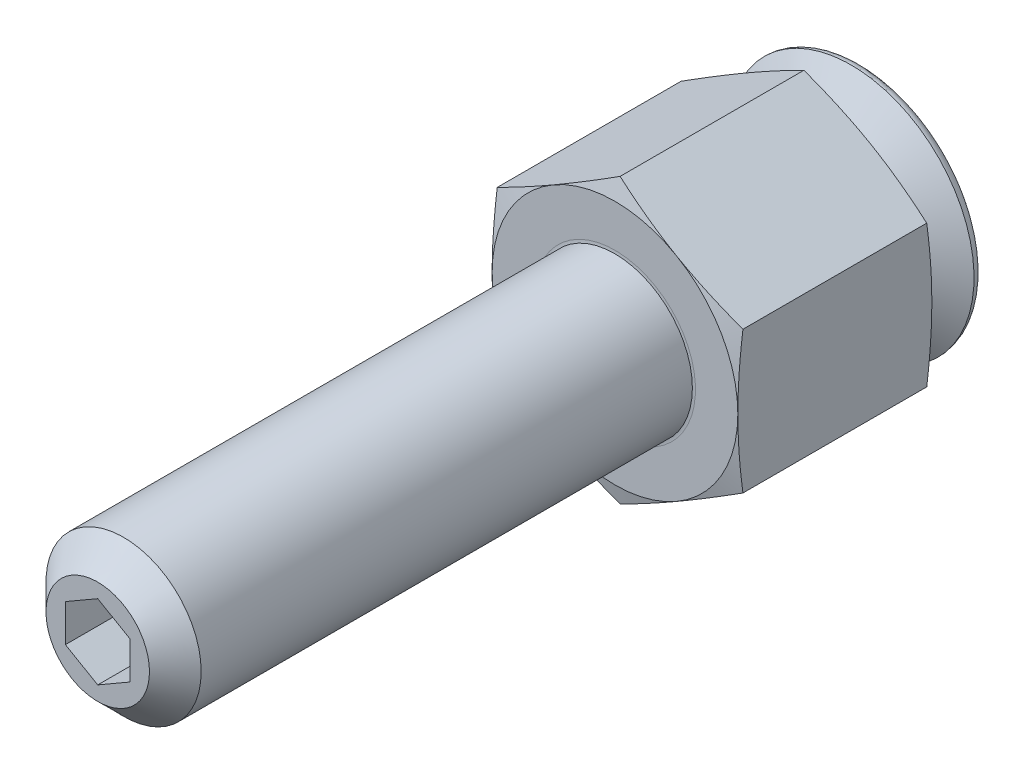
ISO-10303-21;
HEADER;
FILE_DESCRIPTION(('STEP AP214'),'2;1');
FILE_NAME('part.step','',(''),(''),'','','');
FILE_SCHEMA(('AUTOMOTIVE_DESIGN { 1 0 10303 214 1 1 1 1 }'));
ENDSEC;
DATA;
#1=APPLICATION_CONTEXT('core data for automotive mechanical design processes');
#2=APPLICATION_PROTOCOL_DEFINITION('international standard','automotive_design',2000,#1);
#3=PRODUCT_CONTEXT('',#1,'mechanical');
#4=PRODUCT('Part','Part','',(#3));
#5=PRODUCT_RELATED_PRODUCT_CATEGORY('part','',(#4));
#6=PRODUCT_DEFINITION_FORMATION('','',#4);
#7=PRODUCT_DEFINITION_CONTEXT('part definition',#1,'design');
#8=PRODUCT_DEFINITION('design','',#6,#7);
#9=PRODUCT_DEFINITION_SHAPE('','',#8);
#10=(LENGTH_UNIT() NAMED_UNIT(*) SI_UNIT(.MILLI.,.METRE.));
#11=(NAMED_UNIT(*) PLANE_ANGLE_UNIT() SI_UNIT($,.RADIAN.));
#12=(NAMED_UNIT(*) SI_UNIT($,.STERADIAN.) SOLID_ANGLE_UNIT());
#13=UNCERTAINTY_MEASURE_WITH_UNIT(LENGTH_MEASURE(1.E-05),#10,'distance_accuracy_value','');
#14=(GEOMETRIC_REPRESENTATION_CONTEXT(3) GLOBAL_UNCERTAINTY_ASSIGNED_CONTEXT((#13)) GLOBAL_UNIT_ASSIGNED_CONTEXT((#10,
#11,#12)) REPRESENTATION_CONTEXT('',''));
#15=CARTESIAN_POINT('',(0.,0.,0.));
#16=DIRECTION('',(0.,0.,1.));
#17=DIRECTION('',(1.,0.,0.));
#18=AXIS2_PLACEMENT_3D('',#15,#16,#17);
#19=CARTESIAN_POINT('',(0.,0.,6.775599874));
#20=DIRECTION('',(0.,0.,-1.));
#21=DIRECTION('',(-0.24616653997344,0.969227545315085,0.));
#22=AXIS2_PLACEMENT_3D('',#19,#20,#21);
#23=SPHERICAL_SURFACE('',#22,7.5);
#24=CARTESIAN_POINT('',(0.,0.,4.9143998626));
#25=DIRECTION('',(0.,0.,-1.));
#26=DIRECTION('',(0.24616653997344,-0.969227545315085,0.));
#27=AXIS2_PLACEMENT_3D('',#24,#25,#26);
#28=CIRCLE('',#27,7.26539293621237);
#29=CARTESIAN_POINT('',(-1.78849664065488,7.04181896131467,4.9143998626));
#30=VERTEX_POINT('',#29);
#31=EDGE_CURVE('E9',#30,#30,#28,.F.);
#32=CARTESIAN_POINT('',(0.,0.,3.78746603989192));
#33=DIRECTION('',(0.,0.,1.));
#34=DIRECTION('',(-0.24616653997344,0.969227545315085,0.));
#35=AXIS2_PLACEMENT_3D('',#32,#33,#34);
#36=CIRCLE('',#35,6.87903017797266);
#37=CARTESIAN_POINT('',(-1.69338705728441,6.66734553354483,3.78746603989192));
#38=VERTEX_POINT('',#37);
#39=EDGE_CURVE('E358',#38,#38,#36,.T.);
#40=CARTESIAN_POINT('',(-1.78849664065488,7.04181896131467,4.9143998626));
#41=CARTESIAN_POINT('',(-1.78773775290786,7.03883100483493,4.90236573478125));
#42=CARTESIAN_POINT('',(-1.78697150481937,7.03581406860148,4.89033926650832));
#43=CARTESIAN_POINT('',(-1.78542430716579,7.02972231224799,4.86630194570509));
#44=CARTESIAN_POINT('',(-1.78464335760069,7.02664749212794,4.85429109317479));
#45=CARTESIAN_POINT('',(-1.78306677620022,7.02044004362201,4.83028530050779));
#46=CARTESIAN_POINT('',(-1.78227114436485,7.01730741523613,4.81829036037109));
#47=CARTESIAN_POINT('',(-1.78066521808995,7.0109844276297,4.79431668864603));
#48=CARTESIAN_POINT('',(-1.77985492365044,7.00779406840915,4.78233795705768));
#49=CARTESIAN_POINT('',(-1.77821969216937,7.00135569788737,4.75839699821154));
#50=CARTESIAN_POINT('',(-1.77739475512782,6.99810768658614,4.74643477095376));
#51=CARTESIAN_POINT('',(-1.77573025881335,6.99155409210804,4.72252711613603));
#52=CARTESIAN_POINT('',(-1.77489069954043,6.98824850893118,4.7105816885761));
#53=CARTESIAN_POINT('',(-1.77319697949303,6.98157985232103,4.68670792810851));
#54=CARTESIAN_POINT('',(-1.77234281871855,6.97821677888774,4.67477959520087));
#55=CARTESIAN_POINT('',(-1.77061991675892,6.97143322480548,4.6509403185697));
#56=CARTESIAN_POINT('',(-1.76975117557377,6.96801274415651,4.63902937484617));
#57=CARTESIAN_POINT('',(-1.76799913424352,6.96111446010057,4.61522517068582));
#58=CARTESIAN_POINT('',(-1.76711583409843,6.95763665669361,4.603331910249));
#59=CARTESIAN_POINT('',(-1.76533469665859,6.95062381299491,4.57956336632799));
#60=CARTESIAN_POINT('',(-1.76443685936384,6.94708877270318,4.5676880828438));
#61=CARTESIAN_POINT('',(-1.7626266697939,6.93996154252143,4.5439557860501));
#62=CARTESIAN_POINT('',(-1.7617143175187,6.93636935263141,4.53209877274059));
#63=CARTESIAN_POINT('',(-1.75987512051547,6.92912791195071,4.50840330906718));
#64=CARTESIAN_POINT('',(-1.75894827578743,6.92547866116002,4.49656485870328));
#65=CARTESIAN_POINT('',(-1.75708011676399,6.91812318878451,4.47290681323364));
#66=CARTESIAN_POINT('',(-1.75613880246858,6.9144169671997,4.46108721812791));
#67=CARTESIAN_POINT('',(-1.75424172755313,6.90694764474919,4.43746717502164));
#68=CARTESIAN_POINT('',(-1.75328596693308,6.90318454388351,4.42566672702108));
#69=CARTESIAN_POINT('',(-1.7513600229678,6.89560155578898,4.40208526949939));
#70=CARTESIAN_POINT('',(-1.75038983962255,6.89178166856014,4.39030425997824));
#71=CARTESIAN_POINT('',(-1.74843507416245,6.88408520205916,4.3667619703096));
#72=CARTESIAN_POINT('',(-1.74745049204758,6.88020862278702,4.3550006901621));
#73=CARTESIAN_POINT('',(-1.74546695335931,6.87239886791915,4.33149814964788));
#74=CARTESIAN_POINT('',(-1.74446799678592,6.86846569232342,4.31975688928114));
#75=CARTESIAN_POINT('',(-1.74245573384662,6.86054284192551,4.29629467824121));
#76=CARTESIAN_POINT('',(-1.74144242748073,6.85655316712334,4.28457372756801));
#77=CARTESIAN_POINT('',(-1.73940148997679,6.84851741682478,4.26115242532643));
#78=CARTESIAN_POINT('',(-1.73837385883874,6.8444713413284,4.24945207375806));
#79=CARTESIAN_POINT('',(-1.73630429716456,6.83632288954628,4.2260722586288));
#80=CARTESIAN_POINT('',(-1.73526236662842,6.83222051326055,4.21439279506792));
#81=CARTESIAN_POINT('',(-1.73316423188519,6.82395956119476,4.19105504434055));
#82=CARTESIAN_POINT('',(-1.7321080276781,6.8198009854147,4.17939675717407));
#83=CARTESIAN_POINT('',(-1.72998137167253,6.81142773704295,4.1561016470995));
#84=CARTESIAN_POINT('',(-1.72891091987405,6.80721306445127,4.14446482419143));
#85=CARTESIAN_POINT('',(-1.72675579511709,6.79872772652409,4.12121292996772));
#86=CARTESIAN_POINT('',(-1.7256711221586,6.7944570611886,4.10959785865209));
#87=CARTESIAN_POINT('',(-1.72348758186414,6.78585984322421,4.08638975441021));
#88=CARTESIAN_POINT('',(-1.72238871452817,6.7815332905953,4.07479672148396));
#89=CARTESIAN_POINT('',(-1.72017681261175,6.77282440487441,4.05163298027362));
#90=CARTESIAN_POINT('',(-1.71906377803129,6.76844207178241,4.04006227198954));
#91=CARTESIAN_POINT('',(-1.71682356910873,6.75962173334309,4.01694346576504));
#92=CARTESIAN_POINT('',(-1.71569639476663,6.75518372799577,4.00539536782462));
#93=CARTESIAN_POINT('',(-1.71342793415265,6.74625215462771,3.98232206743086));
#94=CARTESIAN_POINT('',(-1.71228664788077,6.74175858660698,3.97079686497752));
#95=CARTESIAN_POINT('',(-1.709989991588,6.73271599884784,3.94776964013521));
#96=CARTESIAN_POINT('',(-1.70883462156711,6.72816697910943,3.93626761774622));
#97=CARTESIAN_POINT('',(-1.70650982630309,6.71901360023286,3.91328703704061));
#98=CARTESIAN_POINT('',(-1.70534040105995,6.71440924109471,3.90180847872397));
#99=CARTESIAN_POINT('',(-1.70298752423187,6.70514529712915,3.87887510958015));
#100=CARTESIAN_POINT('',(-1.70180407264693,6.70048571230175,3.86742029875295));
#101=CARTESIAN_POINT('',(-1.69942317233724,6.6911114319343,3.84453470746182));
#102=CARTESIAN_POINT('',(-1.6982257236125,6.68639673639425,3.83310392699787));
#103=CARTESIAN_POINT('',(-1.69581685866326,6.67691235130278,3.81026667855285));
#104=CARTESIAN_POINT('',(-1.69460544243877,6.67214266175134,3.79886021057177));
#105=CARTESIAN_POINT('',(-1.69338705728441,6.66734553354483,3.78746603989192));
#106=B_SPLINE_CURVE_WITH_KNOTS('',3,(#40,#41,#42,#43,#44,#45,#46,#47,#48,#49,#50,#51,#52,#53,
#54,#55,#56,#57,#58,#59,#60,#61,#62,#63,#64,#65,#66,#67,#68,#69,#70,#71,#72,#73,#74,#75,#76,#77,
#78,#79,#80,#81,#82,#83,#84,#85,#86,#87,#88,#89,#90,#91,#92,#93,#94,#95,#96,#97,#98,#99,#100,
#101,#102,#103,#104,#105),.UNSPECIFIED.,.F.,.F.,(4,2,2,2,2,2,2,2,2,2,2,2,2,2,2,2,2,2,2,2,2,2,2,
2,2,2,2,2,2,2,2,2,4),(0.,0.0372681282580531,0.0745362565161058,0.111804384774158,
0.149072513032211,0.186340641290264,0.223608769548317,0.260876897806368,0.298145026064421,
0.335413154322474,0.372681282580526,0.409949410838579,0.447217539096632,0.484485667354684,
0.521753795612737,0.55902192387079,0.596290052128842,0.633558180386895,0.670826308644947,
0.708094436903,0.745362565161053,0.782630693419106,0.819898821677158,0.857166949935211,
0.894435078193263,0.931703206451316,0.968971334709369,1.00623946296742,1.04350759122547,
1.08077571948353,1.11804384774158,1.15531197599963,1.19258010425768),.UNSPECIFIED.);
#107=EDGE_CURVE('BSEAM14',#30,#38,#106,.T.);
#108=ORIENTED_EDGE('',*,*,#31,.F.);
#109=ORIENTED_EDGE('',*,*,#39,.T.);
#110=ORIENTED_EDGE('',*,*,#107,.T.);
#111=ORIENTED_EDGE('',*,*,#107,.F.);
#112=EDGE_LOOP('',(#108,#110,#109,#111));
#113=FACE_BOUND('',#112,.T.);
#114=ADVANCED_FACE('F14',(#113),#23,.T.);
#115=CARTESIAN_POINT('',(0.,0.,0.));
#116=DIRECTION('',(0.,0.,-1.));
#117=DIRECTION('',(0.24616653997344,-0.969227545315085,0.));
#118=AXIS2_PLACEMENT_3D('',#115,#116,#117);
#119=CYLINDRICAL_SURFACE('',#118,6.858);
#120=CARTESIAN_POINT('',(0.,0.,3.68626790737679));
#121=DIRECTION('',(0.,0.,1.));
#122=DIRECTION('',(-0.24616653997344,0.969227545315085,0.));
#123=AXIS2_PLACEMENT_3D('',#120,#121,#122);
#124=CIRCLE('',#123,6.858);
#125=CARTESIAN_POINT('',(-1.68821013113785,6.64696250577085,3.68626790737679));
#126=VERTEX_POINT('',#125);
#127=EDGE_CURVE('E356',#126,#126,#124,.F.);
#128=ORIENTED_EDGE('',*,*,#127,.T.);
#129=EDGE_LOOP('',(#128));
#130=FACE_BOUND('',#129,.T.);
#131=CARTESIAN_POINT('',(0.,0.,2.43400637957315));
#132=DIRECTION('',(0.,0.,-1.));
#133=DIRECTION('',(0.24616653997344,-0.969227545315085,0.));
#134=AXIS2_PLACEMENT_3D('',#131,#132,#133);
#135=CIRCLE('',#134,6.858);
#136=CARTESIAN_POINT('',(1.68821013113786,-6.64696250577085,2.43400637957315));
#137=VERTEX_POINT('',#136);
#138=EDGE_CURVE('E353',#137,#137,#135,.F.);
#139=ORIENTED_EDGE('',*,*,#138,.T.);
#140=EDGE_LOOP('',(#139));
#141=FACE_BOUND('',#140,.T.);
#142=ADVANCED_FACE('F377',(#130,#141),#119,.T.);
#143=CARTESIAN_POINT('',(0.,0.,2.28735941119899));
#144=DIRECTION('',(0.,0.,-1.));
#145=DIRECTION('',(0.24616653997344,-0.969227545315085,0.));
#146=AXIS2_PLACEMENT_3D('',#143,#144,#145);
#147=CONICAL_SURFACE('',#146,6.858,1.0471975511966);
#148=CARTESIAN_POINT('',(0.,0.,2.2140359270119));
#149=DIRECTION('',(0.,0.,-1.));
#150=DIRECTION('',(0.24616653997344,-0.969227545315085,0.));
#151=AXIS2_PLACEMENT_3D('',#148,#149,#150);
#152=CIRCLE('',#151,6.985);
#153=CARTESIAN_POINT('',(1.71947328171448,-6.77005440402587,2.2140359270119));
#154=VERTEX_POINT('',#153);
#155=EDGE_CURVE('E18',#154,#154,#152,.T.);
#156=ORIENTED_EDGE('',*,*,#155,.T.);
#157=EDGE_LOOP('',(#156));
#158=FACE_BOUND('',#157,.T.);
#159=CARTESIAN_POINT('',(0.,0.,0.762));
#160=DIRECTION('',(0.,0.,-1.));
#161=DIRECTION('',(0.24616653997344,-0.969227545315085,0.));
#162=AXIS2_PLACEMENT_3D('',#159,#160,#161);
#163=CIRCLE('',#162,9.5);
#164=CARTESIAN_POINT('',(2.33858212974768,-9.20766168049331,0.762));
#165=VERTEX_POINT('',#164);
#166=EDGE_CURVE('E347',#165,#165,#163,.T.);
#167=ORIENTED_EDGE('',*,*,#166,.F.);
#168=EDGE_LOOP('',(#167));
#169=FACE_BOUND('',#168,.T.);
#170=ADVANCED_FACE('F383',(#158,#169),#147,.T.);
#171=CARTESIAN_POINT('',(-2.33858212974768,9.2076616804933,0.));
#172=DIRECTION('',(0.,0.,1.));
#173=DIRECTION('',(-0.24616653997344,0.969227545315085,0.));
#174=AXIS2_PLACEMENT_3D('',#171,#172,#173);
#175=PLANE('',#174);
#176=CARTESIAN_POINT('',(0.,0.,0.));
#177=DIRECTION('',(0.,0.,1.));
#178=DIRECTION('',(-0.24616653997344,0.969227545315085,0.));
#179=AXIS2_PLACEMENT_3D('',#176,#177,#178);
#180=CIRCLE('',#179,8.738);
#181=CARTESIAN_POINT('',(-2.15100322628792,8.46911029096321,0.));
#182=VERTEX_POINT('',#181);
#183=EDGE_CURVE('E350',#182,#182,#180,.F.);
#184=ORIENTED_EDGE('',*,*,#183,.T.);
#185=EDGE_LOOP('',(#184));
#186=FACE_BOUND('',#185,.T.);
#187=ADVANCED_FACE('F491',(#186),#175,.F.);
#188=CARTESIAN_POINT('',(0.,0.,0.762));
#189=DIRECTION('',(0.,0.,1.));
#190=DIRECTION('',(-0.24616653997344,0.969227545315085,0.));
#191=AXIS2_PLACEMENT_3D('',#188,#189,#190);
#192=TOROIDAL_SURFACE('',#191,8.738,0.762);
#193=ORIENTED_EDGE('',*,*,#166,.T.);
#194=EDGE_LOOP('',(#193));
#195=FACE_BOUND('',#194,.T.);
#196=ORIENTED_EDGE('',*,*,#183,.F.);
#197=EDGE_LOOP('',(#196));
#198=FACE_BOUND('',#197,.T.);
#199=ADVANCED_FACE('F494',(#195,#198),#192,.T.);
#200=CARTESIAN_POINT('',(0.,0.,3.68626790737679));
#201=DIRECTION('',(0.,0.,1.));
#202=DIRECTION('',(-0.24616653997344,0.969227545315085,0.));
#203=AXIS2_PLACEMENT_3D('',#200,#201,#202);
#204=TOROIDAL_SURFACE('',#203,7.112,0.254);
#205=ORIENTED_EDGE('',*,*,#39,.F.);
#206=EDGE_LOOP('',(#205));
#207=FACE_BOUND('',#206,.T.);
#208=ORIENTED_EDGE('',*,*,#127,.F.);
#209=EDGE_LOOP('',(#208));
#210=FACE_BOUND('',#209,.T.);
#211=ADVANCED_FACE('F395',(#207,#210),#204,.F.);
#212=CARTESIAN_POINT('',(0.,0.,2.43400637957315));
#213=DIRECTION('',(0.,0.,-1.));
#214=DIRECTION('',(0.24616653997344,-0.969227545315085,0.));
#215=AXIS2_PLACEMENT_3D('',#212,#213,#214);
#216=TOROIDAL_SURFACE('',#215,7.112,0.254);
#217=ORIENTED_EDGE('',*,*,#138,.F.);
#218=EDGE_LOOP('',(#217));
#219=FACE_BOUND('',#218,.T.);
#220=ORIENTED_EDGE('',*,*,#155,.F.);
#221=EDGE_LOOP('',(#220));
#222=FACE_BOUND('',#221,.T.);
#223=ADVANCED_FACE('F16',(#219,#222),#216,.F.);
#224=CARTESIAN_POINT('',(5.,0.,54.0253998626));
#225=DIRECTION('',(0.,0.,-1.));
#226=DIRECTION('',(-1.,0.,0.));
#227=AXIS2_PLACEMENT_3D('',#224,#225,#226);
#228=PLANE('',#227);
#229=DIRECTION('',(-0.866025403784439,0.5,0.));
#230=VECTOR('',#229,1.);
#231=CARTESIAN_POINT('',(2.5,1.44337567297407,54.0253998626));
#232=LINE('',#231,#230);
#233=CARTESIAN_POINT('',(2.5,1.44337567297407,54.0253998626));
#234=VERTEX_POINT('',#233);
#235=CARTESIAN_POINT('',(0.,2.88675134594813,54.0253998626));
#236=VERTEX_POINT('',#235);
#237=EDGE_CURVE('E143',#234,#236,#232,.T.);
#238=ORIENTED_EDGE('',*,*,#237,.T.);
#239=DIRECTION('',(-0.866025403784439,-0.5,0.));
#240=VECTOR('',#239,1.);
#241=CARTESIAN_POINT('',(0.,2.88675134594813,54.0253998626));
#242=LINE('',#241,#240);
#243=CARTESIAN_POINT('',(-2.5,1.44337567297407,54.0253998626));
#244=VERTEX_POINT('',#243);
#245=EDGE_CURVE('E152',#236,#244,#242,.T.);
#246=ORIENTED_EDGE('',*,*,#245,.T.);
#247=DIRECTION('',(0.,-1.,0.));
#248=VECTOR('',#247,1.);
#249=CARTESIAN_POINT('',(-2.5,1.44337567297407,54.0253998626));
#250=LINE('',#249,#248);
#251=CARTESIAN_POINT('',(-2.5,-1.44337567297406,54.0253998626));
#252=VERTEX_POINT('',#251);
#253=EDGE_CURVE('E157',#244,#252,#250,.T.);
#254=ORIENTED_EDGE('',*,*,#253,.T.);
#255=DIRECTION('',(0.866025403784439,-0.5,0.));
#256=VECTOR('',#255,1.);
#257=CARTESIAN_POINT('',(-2.5,-1.44337567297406,54.0253998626));
#258=LINE('',#257,#256);
#259=CARTESIAN_POINT('',(0.,-2.88675134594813,54.0253998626));
#260=VERTEX_POINT('',#259);
#261=EDGE_CURVE('E171',#252,#260,#258,.T.);
#262=ORIENTED_EDGE('',*,*,#261,.T.);
#263=DIRECTION('',(0.866025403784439,0.5,0.));
#264=VECTOR('',#263,1.);
#265=CARTESIAN_POINT('',(0.,-2.88675134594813,54.0253998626));
#266=LINE('',#265,#264);
#267=CARTESIAN_POINT('',(2.5,-1.44337567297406,54.0253998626));
#268=VERTEX_POINT('',#267);
#269=EDGE_CURVE('E174',#260,#268,#266,.T.);
#270=ORIENTED_EDGE('',*,*,#269,.T.);
#271=DIRECTION('',(0.,1.,0.));
#272=VECTOR('',#271,1.);
#273=CARTESIAN_POINT('',(2.5,-1.44337567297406,54.0253998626));
#274=LINE('',#273,#272);
#275=EDGE_CURVE('E149',#268,#234,#274,.T.);
#276=ORIENTED_EDGE('',*,*,#275,.T.);
#277=EDGE_LOOP('',(#238,#246,#254,#262,#270,#276));
#278=FACE_BOUND('',#277,.T.);
#279=ADVANCED_FACE('F159',(#278),#228,.F.);
#280=CARTESIAN_POINT('',(0.,2.88675134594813,54.0253998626));
#281=DIRECTION('',(-0.5,0.866025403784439,0.));
#282=DIRECTION('',(0.866025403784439,0.5,0.));
#283=AXIS2_PLACEMENT_3D('',#280,#281,#282);
#284=PLANE('',#283);
#285=DIRECTION('',(-0.866025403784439,-0.5,0.));
#286=VECTOR('',#285,1.);
#287=CARTESIAN_POINT('',(0.,2.88675134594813,59.0253998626));
#288=LINE('',#287,#286);
#289=CARTESIAN_POINT('',(0.,2.88675134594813,59.0253998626));
#290=VERTEX_POINT('',#289);
#291=CARTESIAN_POINT('',(-2.5,1.44337567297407,59.0253998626));
#292=VERTEX_POINT('',#291);
#293=EDGE_CURVE('E178',#290,#292,#288,.T.);
#294=ORIENTED_EDGE('',*,*,#293,.T.);
#295=DIRECTION('',(0.,0.,1.));
#296=VECTOR('',#295,1.);
#297=CARTESIAN_POINT('',(-2.5,1.44337567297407,54.0253998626));
#298=LINE('',#297,#296);
#299=EDGE_CURVE('E148',#244,#292,#298,.T.);
#300=ORIENTED_EDGE('',*,*,#299,.F.);
#301=ORIENTED_EDGE('',*,*,#245,.F.);
#302=DIRECTION('',(0.,0.,1.));
#303=VECTOR('',#302,1.);
#304=CARTESIAN_POINT('',(0.,2.88675134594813,54.0253998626));
#305=LINE('',#304,#303);
#306=EDGE_CURVE('E139',#236,#290,#305,.T.);
#307=ORIENTED_EDGE('',*,*,#306,.T.);
#308=EDGE_LOOP('',(#294,#300,#301,#307));
#309=FACE_BOUND('',#308,.T.);
#310=ADVANCED_FACE('F153',(#309),#284,.F.);
#311=CARTESIAN_POINT('',(-2.5,1.44337567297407,54.0253998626));
#312=DIRECTION('',(-1.,0.,0.));
#313=DIRECTION('',(0.,0.,1.));
#314=AXIS2_PLACEMENT_3D('',#311,#312,#313);
#315=PLANE('',#314);
#316=DIRECTION('',(0.,-1.,0.));
#317=VECTOR('',#316,1.);
#318=CARTESIAN_POINT('',(-2.5,1.44337567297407,59.0253998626));
#319=LINE('',#318,#317);
#320=CARTESIAN_POINT('',(-2.5,-1.44337567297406,59.0253998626));
#321=VERTEX_POINT('',#320);
#322=EDGE_CURVE('E180',#292,#321,#319,.T.);
#323=ORIENTED_EDGE('',*,*,#322,.T.);
#324=DIRECTION('',(0.,0.,1.));
#325=VECTOR('',#324,1.);
#326=CARTESIAN_POINT('',(-2.5,-1.44337567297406,54.0253998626));
#327=LINE('',#326,#325);
#328=EDGE_CURVE('E195',#252,#321,#327,.T.);
#329=ORIENTED_EDGE('',*,*,#328,.F.);
#330=ORIENTED_EDGE('',*,*,#253,.F.);
#331=ORIENTED_EDGE('',*,*,#299,.T.);
#332=EDGE_LOOP('',(#323,#329,#330,#331));
#333=FACE_BOUND('',#332,.T.);
#334=ADVANCED_FACE('F393',(#333),#315,.F.);
#335=CARTESIAN_POINT('',(-2.5,-1.44337567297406,54.0253998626));
#336=DIRECTION('',(-0.5,-0.866025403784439,0.));
#337=DIRECTION('',(-0.866025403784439,0.5,0.));
#338=AXIS2_PLACEMENT_3D('',#335,#336,#337);
#339=PLANE('',#338);
#340=DIRECTION('',(0.866025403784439,-0.5,0.));
#341=VECTOR('',#340,1.);
#342=CARTESIAN_POINT('',(-2.5,-1.44337567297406,59.0253998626));
#343=LINE('',#342,#341);
#344=CARTESIAN_POINT('',(0.,-2.88675134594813,59.0253998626));
#345=VERTEX_POINT('',#344);
#346=EDGE_CURVE('E183',#321,#345,#343,.T.);
#347=ORIENTED_EDGE('',*,*,#346,.T.);
#348=DIRECTION('',(0.,0.,1.));
#349=VECTOR('',#348,1.);
#350=CARTESIAN_POINT('',(0.,-2.88675134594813,54.0253998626));
#351=LINE('',#350,#349);
#352=EDGE_CURVE('E193',#260,#345,#351,.T.);
#353=ORIENTED_EDGE('',*,*,#352,.F.);
#354=ORIENTED_EDGE('',*,*,#261,.F.);
#355=ORIENTED_EDGE('',*,*,#328,.T.);
#356=EDGE_LOOP('',(#347,#353,#354,#355));
#357=FACE_BOUND('',#356,.T.);
#358=ADVANCED_FACE('F405',(#357),#339,.F.);
#359=CARTESIAN_POINT('',(0.,-2.88675134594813,54.0253998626));
#360=DIRECTION('',(0.5,-0.866025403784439,0.));
#361=DIRECTION('',(-0.866025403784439,-0.5,0.));
#362=AXIS2_PLACEMENT_3D('',#359,#360,#361);
#363=PLANE('',#362);
#364=DIRECTION('',(0.866025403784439,0.5,0.));
#365=VECTOR('',#364,1.);
#366=CARTESIAN_POINT('',(0.,-2.88675134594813,59.0253998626));
#367=LINE('',#366,#365);
#368=CARTESIAN_POINT('',(2.5,-1.44337567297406,59.0253998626));
#369=VERTEX_POINT('',#368);
#370=EDGE_CURVE('E165',#345,#369,#367,.T.);
#371=ORIENTED_EDGE('',*,*,#370,.T.);
#372=DIRECTION('',(0.,0.,1.));
#373=VECTOR('',#372,1.);
#374=CARTESIAN_POINT('',(2.5,-1.44337567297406,54.0253998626));
#375=LINE('',#374,#373);
#376=EDGE_CURVE('E191',#268,#369,#375,.T.);
#377=ORIENTED_EDGE('',*,*,#376,.F.);
#378=ORIENTED_EDGE('',*,*,#269,.F.);
#379=ORIENTED_EDGE('',*,*,#352,.T.);
#380=EDGE_LOOP('',(#371,#377,#378,#379));
#381=FACE_BOUND('',#380,.T.);
#382=ADVANCED_FACE('F401',(#381),#363,.F.);
#383=CARTESIAN_POINT('',(2.5,-1.44337567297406,54.0253998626));
#384=DIRECTION('',(1.,0.,0.));
#385=DIRECTION('',(0.,0.,-1.));
#386=AXIS2_PLACEMENT_3D('',#383,#384,#385);
#387=PLANE('',#386);
#388=DIRECTION('',(0.,1.,0.));
#389=VECTOR('',#388,1.);
#390=CARTESIAN_POINT('',(2.5,-1.44337567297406,59.0253998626));
#391=LINE('',#390,#389);
#392=CARTESIAN_POINT('',(2.5,1.44337567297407,59.0253998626));
#393=VERTEX_POINT('',#392);
#394=EDGE_CURVE('E162',#369,#393,#391,.T.);
#395=ORIENTED_EDGE('',*,*,#394,.T.);
#396=DIRECTION('',(0.,0.,1.));
#397=VECTOR('',#396,1.);
#398=CARTESIAN_POINT('',(2.5,1.44337567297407,54.0253998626));
#399=LINE('',#398,#397);
#400=EDGE_CURVE('E188',#234,#393,#399,.T.);
#401=ORIENTED_EDGE('',*,*,#400,.F.);
#402=ORIENTED_EDGE('',*,*,#275,.F.);
#403=ORIENTED_EDGE('',*,*,#376,.T.);
#404=EDGE_LOOP('',(#395,#401,#402,#403));
#405=FACE_BOUND('',#404,.T.);
#406=ADVANCED_FACE('F398',(#405),#387,.F.);
#407=CARTESIAN_POINT('',(2.5,1.44337567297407,54.0253998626));
#408=DIRECTION('',(0.5,0.866025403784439,0.));
#409=DIRECTION('',(0.866025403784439,-0.5,0.));
#410=AXIS2_PLACEMENT_3D('',#407,#408,#409);
#411=PLANE('',#410);
#412=DIRECTION('',(-0.866025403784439,0.5,0.));
#413=VECTOR('',#412,1.);
#414=CARTESIAN_POINT('',(2.5,1.44337567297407,59.0253998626));
#415=LINE('',#414,#413);
#416=EDGE_CURVE('E31',#393,#290,#415,.T.);
#417=ORIENTED_EDGE('',*,*,#416,.T.);
#418=ORIENTED_EDGE('',*,*,#306,.F.);
#419=ORIENTED_EDGE('',*,*,#237,.F.);
#420=ORIENTED_EDGE('',*,*,#400,.T.);
#421=EDGE_LOOP('',(#417,#418,#419,#420));
#422=FACE_BOUND('',#421,.T.);
#423=ADVANCED_FACE('F141',(#422),#411,.F.);
#424=CARTESIAN_POINT('',(0.,0.,59.0253998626));
#425=DIRECTION('',(0.,0.,1.));
#426=DIRECTION('',(1.,0.,0.));
#427=AXIS2_PLACEMENT_3D('',#424,#425,#426);
#428=PLANE('',#427);
#429=ORIENTED_EDGE('',*,*,#416,.F.);
#430=ORIENTED_EDGE('',*,*,#394,.F.);
#431=ORIENTED_EDGE('',*,*,#370,.F.);
#432=ORIENTED_EDGE('',*,*,#346,.F.);
#433=ORIENTED_EDGE('',*,*,#322,.F.);
#434=ORIENTED_EDGE('',*,*,#293,.F.);
#435=EDGE_LOOP('',(#429,#430,#431,#432,#433,#434));
#436=FACE_BOUND('',#435,.T.);
#437=CARTESIAN_POINT('',(0.,0.,59.0253998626));
#438=DIRECTION('',(0.,0.,1.));
#439=DIRECTION('',(1.,0.,0.));
#440=AXIS2_PLACEMENT_3D('',#437,#438,#439);
#441=CIRCLE('',#440,4.);
#442=CARTESIAN_POINT('',(4.,0.,59.0253998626));
#443=VERTEX_POINT('',#442);
#444=EDGE_CURVE('E342',#443,#443,#441,.T.);
#445=ORIENTED_EDGE('',*,*,#444,.T.);
#446=EDGE_LOOP('',(#445));
#447=FACE_BOUND('',#446,.T.);
#448=ADVANCED_FACE('F415',(#436,#447),#428,.T.);
#449=CARTESIAN_POINT('',(0.,0.,59.0253998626));
#450=DIRECTION('',(0.,0.,-1.));
#451=DIRECTION('',(-1.,0.,0.));
#452=AXIS2_PLACEMENT_3D('',#449,#450,#451);
#453=CONICAL_SURFACE('',#452,4.,0.785398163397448);
#454=CARTESIAN_POINT('',(0.,0.,57.0253998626));
#455=DIRECTION('',(0.,0.,1.));
#456=DIRECTION('',(1.,0.,0.));
#457=AXIS2_PLACEMENT_3D('',#454,#455,#456);
#458=CIRCLE('',#457,6.);
#459=CARTESIAN_POINT('',(6.,0.,57.0253998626));
#460=VERTEX_POINT('',#459);
#461=EDGE_CURVE('E23',#460,#460,#458,.F.);
#462=ORIENTED_EDGE('',*,*,#461,.F.);
#463=EDGE_LOOP('',(#462));
#464=FACE_BOUND('',#463,.T.);
#465=ORIENTED_EDGE('',*,*,#444,.F.);
#466=EDGE_LOOP('',(#465));
#467=FACE_BOUND('',#466,.T.);
#468=ADVANCED_FACE('F417',(#464,#467),#453,.T.);
#469=CARTESIAN_POINT('',(0.,0.,59.0253998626));
#470=DIRECTION('',(0.,0.,-1.));
#471=DIRECTION('',(-1.,0.,0.));
#472=AXIS2_PLACEMENT_3D('',#469,#470,#471);
#473=CYLINDRICAL_SURFACE('',#472,6.);
#474=ORIENTED_EDGE('',*,*,#461,.T.);
#475=EDGE_LOOP('',(#474));
#476=FACE_BOUND('',#475,.T.);
#477=CARTESIAN_POINT('',(0.,0.,19.0418034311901));
#478=DIRECTION('',(0.,0.,1.));
#479=DIRECTION('',(1.,0.,0.));
#480=AXIS2_PLACEMENT_3D('',#477,#478,#479);
#481=CIRCLE('',#480,6.);
#482=CARTESIAN_POINT('',(6.,0.,19.0418034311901));
#483=VERTEX_POINT('',#482);
#484=EDGE_CURVE('E190',#483,#483,#481,.F.);
#485=ORIENTED_EDGE('',*,*,#484,.F.);
#486=EDGE_LOOP('',(#485));
#487=FACE_BOUND('',#486,.T.);
#488=ADVANCED_FACE('F419',(#476,#487),#473,.T.);
#489=CARTESIAN_POINT('',(0.,0.,20.5493998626));
#490=DIRECTION('',(0.,0.,-1.));
#491=DIRECTION('',(-1.,0.,0.));
#492=AXIS2_PLACEMENT_3D('',#489,#490,#491);
#493=TOROIDAL_SURFACE('',#492,6.223,1.524);
#494=ORIENTED_EDGE('',*,*,#484,.T.);
#495=EDGE_LOOP('',(#494));
#496=FACE_BOUND('',#495,.T.);
#497=CARTESIAN_POINT('',(0.,0.,19.0253998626));
#498=DIRECTION('',(0.,0.,-1.));
#499=DIRECTION('',(-1.,0.,0.));
#500=AXIS2_PLACEMENT_3D('',#497,#498,#499);
#501=CIRCLE('',#500,6.223);
#502=CARTESIAN_POINT('',(-6.223,0.,19.0253998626));
#503=VERTEX_POINT('',#502);
#504=EDGE_CURVE('E339',#503,#503,#501,.T.);
#505=ORIENTED_EDGE('',*,*,#504,.F.);
#506=EDGE_LOOP('',(#505));
#507=FACE_BOUND('',#506,.T.);
#508=ADVANCED_FACE('F421',(#496,#507),#493,.F.);
#509=CARTESIAN_POINT('',(-9.5,16.4544826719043,19.0253998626));
#510=DIRECTION('',(0.,0.,-1.));
#511=DIRECTION('',(-1.,0.,0.));
#512=AXIS2_PLACEMENT_3D('',#509,#510,#511);
#513=PLANE('',#512);
#514=CARTESIAN_POINT('',(0.,0.,19.0253998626));
#515=DIRECTION('',(0.,0.,-1.));
#516=DIRECTION('',(-1.,0.,0.));
#517=AXIS2_PLACEMENT_3D('',#514,#515,#516);
#518=CIRCLE('',#517,9.5);
#519=CARTESIAN_POINT('',(-9.5,0.,19.0253998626));
#520=VERTEX_POINT('',#519);
#521=CARTESIAN_POINT('',(-4.75,8.22724133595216,19.0253998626));
#522=VERTEX_POINT('',#521);
#523=EDGE_CURVE('E451',#520,#522,#518,.T.);
#524=ORIENTED_EDGE('',*,*,#523,.F.);
#525=CARTESIAN_POINT('',(0.,0.,19.0253998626));
#526=DIRECTION('',(0.,0.,-1.));
#527=DIRECTION('',(-1.,0.,0.));
#528=AXIS2_PLACEMENT_3D('',#525,#526,#527);
#529=CIRCLE('',#528,9.5);
#530=CARTESIAN_POINT('',(-4.75,-8.22724133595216,19.0253998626));
#531=VERTEX_POINT('',#530);
#532=EDGE_CURVE('E308',#531,#520,#529,.T.);
#533=ORIENTED_EDGE('',*,*,#532,.F.);
#534=CARTESIAN_POINT('',(4.75,-8.22724133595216,19.0253998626));
#535=VERTEX_POINT('',#534);
#536=EDGE_CURVE('E326',#535,#531,#529,.T.);
#537=ORIENTED_EDGE('',*,*,#536,.F.);
#538=CARTESIAN_POINT('',(9.5,0.,19.0253998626));
#539=VERTEX_POINT('',#538);
#540=EDGE_CURVE('E819',#539,#535,#529,.T.);
#541=ORIENTED_EDGE('',*,*,#540,.F.);
#542=CARTESIAN_POINT('',(4.75,8.22724133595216,19.0253998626));
#543=VERTEX_POINT('',#542);
#544=EDGE_CURVE('E806',#543,#539,#529,.T.);
#545=ORIENTED_EDGE('',*,*,#544,.F.);
#546=EDGE_CURVE('E327',#522,#543,#529,.T.);
#547=ORIENTED_EDGE('',*,*,#546,.F.);
#548=EDGE_LOOP('',(#524,#533,#537,#541,#545,#547));
#549=FACE_BOUND('',#548,.T.);
#550=ORIENTED_EDGE('',*,*,#504,.T.);
#551=EDGE_LOOP('',(#550));
#552=FACE_BOUND('',#551,.T.);
#553=ADVANCED_FACE('F427',(#549,#552),#513,.F.);
#554=CARTESIAN_POINT('',(0.,0.,17.6112361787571));
#555=DIRECTION('',(0.,0.,-1.));
#556=DIRECTION('',(-1.,0.,0.));
#557=AXIS2_PLACEMENT_3D('',#554,#555,#556);
#558=CONICAL_SURFACE('',#557,14.7777307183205,1.30899693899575);
#559=CARTESIAN_POINT('',(9.5,-14.5747016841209,16.9092794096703));
#560=CARTESIAN_POINT('',(9.5,-14.1429588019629,17.0061686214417));
#561=CARTESIAN_POINT('',(9.50000000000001,-13.7109476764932,17.1018837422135));
#562=CARTESIAN_POINT('',(9.50000000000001,-12.8462570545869,17.2903319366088));
#563=CARTESIAN_POINT('',(9.50000000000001,-12.4135775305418,17.383064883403));
#564=CARTESIAN_POINT('',(9.50000000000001,-11.5470400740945,17.5649936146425));
#565=CARTESIAN_POINT('',(9.50000000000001,-11.1131814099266,17.6541859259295));
#566=CARTESIAN_POINT('',(9.50000000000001,-10.2445657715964,17.828081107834));
#567=CARTESIAN_POINT('',(9.50000000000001,-9.80980880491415,17.9127840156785));
#568=CARTESIAN_POINT('',(9.50000000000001,-8.94271422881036,18.0759755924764));
#569=CARTESIAN_POINT('',(9.5,-8.51038497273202,18.1545084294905));
#570=CARTESIAN_POINT('',(9.5,-7.64453986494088,18.3047912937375));
#571=CARTESIAN_POINT('',(9.5,-7.21102400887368,18.3765412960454));
#572=CARTESIAN_POINT('',(9.5,-6.34272998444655,18.5116537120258));
#573=CARTESIAN_POINT('',(9.5,-5.90795197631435,18.5750171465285));
#574=CARTESIAN_POINT('',(9.5,-5.0370103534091,18.6915021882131));
#575=CARTESIAN_POINT('',(9.5,-4.60084673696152,18.7446237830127));
#576=CARTESIAN_POINT('',(9.5,-3.72218440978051,18.8391354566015));
#577=CARTESIAN_POINT('',(9.5,-3.27967029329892,18.8803844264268));
#578=CARTESIAN_POINT('',(9.5,-2.39351554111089,18.9483138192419));
#579=CARTESIAN_POINT('',(9.5,-1.94987493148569,18.9749945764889));
#580=CARTESIAN_POINT('',(9.5,-1.06211305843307,19.0122322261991));
#581=CARTESIAN_POINT('',(9.5,-0.617992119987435,19.0227967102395));
#582=CARTESIAN_POINT('',(9.5,0.27033301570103,19.0271508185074));
#583=CARTESIAN_POINT('',(9.5,0.714537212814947,19.0209404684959));
#584=CARTESIAN_POINT('',(9.5,1.60403584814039,18.9920931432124));
#585=CARTESIAN_POINT('',(9.5,2.04932829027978,18.9693958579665));
#586=CARTESIAN_POINT('',(9.5,2.93887465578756,18.9088757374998));
#587=CARTESIAN_POINT('',(9.5,3.38312855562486,18.8710525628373));
#588=CARTESIAN_POINT('',(9.5,4.2705931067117,18.7822073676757));
#589=CARTESIAN_POINT('',(9.5,4.71380286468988,18.7311765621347));
#590=CARTESIAN_POINT('',(9.5,5.59879334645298,18.6180595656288));
#591=CARTESIAN_POINT('',(9.5,6.04057406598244,18.5559733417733));
#592=CARTESIAN_POINT('',(9.5,6.90095560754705,18.4260426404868));
#593=CARTESIAN_POINT('',(9.5,7.31962297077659,18.3586343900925));
#594=CARTESIAN_POINT('',(9.5,8.15583235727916,18.217134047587));
#595=CARTESIAN_POINT('',(9.5,8.57337434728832,18.1430417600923));
#596=CARTESIAN_POINT('',(9.5,9.4074974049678,17.9894151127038));
#597=CARTESIAN_POINT('',(9.5,9.82407836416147,17.9098801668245));
#598=CARTESIAN_POINT('',(9.5,10.6563643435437,17.7463891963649));
#599=CARTESIAN_POINT('',(9.5,11.0720693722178,17.6624332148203));
#600=CARTESIAN_POINT('',(9.5,11.902841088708,17.4908901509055));
#601=CARTESIAN_POINT('',(9.5,12.3179075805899,17.4033021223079));
#602=CARTESIAN_POINT('',(9.5,13.1474039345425,17.2251572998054));
#603=CARTESIAN_POINT('',(9.5,13.5618337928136,17.1346004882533));
#604=CARTESIAN_POINT('',(9.5,14.8042541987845,16.8592912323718));
#605=CARTESIAN_POINT('',(9.5,15.6314352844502,16.6708874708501));
#606=CARTESIAN_POINT('',(9.5,17.2759460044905,16.2892453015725));
#607=CARTESIAN_POINT('',(9.5,18.0932913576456,16.0960741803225));
#608=CARTESIAN_POINT('',(9.5,19.7268506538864,15.7049451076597));
#609=CARTESIAN_POINT('',(9.49999999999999,20.5430645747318,15.5069870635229));
#610=CARTESIAN_POINT('',(9.49999999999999,22.1735730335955,15.1077966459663));
#611=CARTESIAN_POINT('',(9.49999999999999,22.9878686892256,14.9065688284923));
#612=CARTESIAN_POINT('',(9.49999999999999,24.2087990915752,14.6027268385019));
#613=CARTESIAN_POINT('',(9.49999999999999,24.6156836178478,14.5011145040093));
#614=CARTESIAN_POINT('',(9.49999999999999,25.4293043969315,14.2972996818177));
#615=CARTESIAN_POINT('',(9.5,25.8360406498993,14.1950971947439));
#616=CARTESIAN_POINT('',(9.5,26.2427123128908,14.0926383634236));
#617=B_SPLINE_CURVE_WITH_KNOTS('',3,(#559,#560,#561,#562,#563,#564,#565,#566,#567,#568,#569,
#570,#571,#572,#573,#574,#575,#576,#577,#578,#579,#580,#581,#582,#583,#584,#585,#586,#587,#588,
#589,#590,#591,#592,#593,#594,#595,#596,#597,#598,#599,#600,#601,#602,#603,#604,#605,#606,#607,
#608,#609,#610,#611,#612,#613,#614,#615,#616),.UNSPECIFIED.,.F.,.F.,(4,2,2,2,2,2,2,2,2,2,2,2,2,
2,2,2,2,2,2,2,2,2,2,2,2,2,2,2,4),(0.,1.32744832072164,2.65495302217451,3.98372927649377,
5.31249451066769,6.63066375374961,7.94883784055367,9.26685132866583,10.5848664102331,
11.9179543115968,13.2510116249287,14.5834408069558,15.9158679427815,17.2531938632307,
18.5905497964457,19.9287975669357,21.2670493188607,22.539162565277,23.8113130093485,
25.0836006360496,26.3558758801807,27.6284846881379,28.9011010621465,31.4461508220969,
33.9657206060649,36.4853392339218,39.0017057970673,40.2598472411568,41.5179873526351),.UNSPECIFIED.);
#618=CARTESIAN_POINT('',(9.5,-5.48482755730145,18.6316069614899));
#619=VERTEX_POINT('',#618);
#620=EDGE_CURVE('E304',#539,#619,#617,.F.);
#621=ORIENTED_EDGE('',*,*,#620,.F.);
#622=ORIENTED_EDGE('',*,*,#540,.T.);
#623=CARTESIAN_POINT('',(9.5002,-5.48471208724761,18.6315760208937));
#624=CARTESIAN_POINT('',(9.10567227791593,-5.71249277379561,18.6926346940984));
#625=CARTESIAN_POINT('',(8.71042924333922,-5.9406864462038,18.7480658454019));
#626=CARTESIAN_POINT('',(7.91854737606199,-6.39787965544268,18.8454531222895));
#627=CARTESIAN_POINT('',(7.52190804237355,-6.6268794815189,18.8874037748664));
#628=CARTESIAN_POINT('',(6.72963834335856,-7.08429660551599,18.9553810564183));
#629=CARTESIAN_POINT('',(6.33401333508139,-7.31271081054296,18.9814887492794));
#630=CARTESIAN_POINT('',(5.54225880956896,-7.76983049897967,19.0164964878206));
#631=CARTESIAN_POINT('',(5.14612940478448,-7.99853591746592,19.0253998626));
#632=CARTESIAN_POINT('',(4.35387059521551,-8.45594675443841,19.0253998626));
#633=CARTESIAN_POINT('',(3.95774119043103,-8.68465217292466,19.0164964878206));
#634=CARTESIAN_POINT('',(3.1659866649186,-9.14177186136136,18.9814887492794));
#635=CARTESIAN_POINT('',(2.77036165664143,-9.37018606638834,18.9553810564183));
#636=CARTESIAN_POINT('',(1.97809195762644,-9.82760319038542,18.8874037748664));
#637=CARTESIAN_POINT('',(1.581452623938,-10.0566030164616,18.8454531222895));
#638=CARTESIAN_POINT('',(0.78957075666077,-10.5137962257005,18.7480658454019));
#639=CARTESIAN_POINT('',(0.394327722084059,-10.7419898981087,18.6926346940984));
#640=CARTESIAN_POINT('',(-0.00020000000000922,-10.9697705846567,18.6315760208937));
#641=B_SPLINE_CURVE_WITH_KNOTS('',3,(#623,#624,#625,#626,#627,#628,#629,#630,#631,#632,#633,
#634,#635,#636,#637,#638,#639,#640),.UNSPECIFIED.,.F.,.F.,(4,2,2,2,2,2,2,2,4),(0.,
1.37897722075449,2.75851359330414,4.13093041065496,5.50308163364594,6.87523285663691,
8.24764967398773,9.62718604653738,11.0061632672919),.UNSPECIFIED.);
#642=EDGE_CURVE('E303',#619,#535,#641,.T.);
#643=ORIENTED_EDGE('',*,*,#642,.F.);
#644=EDGE_LOOP('',(#621,#622,#643));
#645=FACE_BOUND('',#644,.T.);
#646=ADVANCED_FACE('F439',(#645),#558,.T.);
#647=CARTESIAN_POINT('',(-0.000200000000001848,10.9697705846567,18.6315760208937));
#648=CARTESIAN_POINT('',(0.394327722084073,10.7419898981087,18.6926346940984));
#649=CARTESIAN_POINT('',(0.789570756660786,10.5137962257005,18.7480658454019));
#650=CARTESIAN_POINT('',(1.58145262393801,10.0566030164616,18.8454531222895));
#651=CARTESIAN_POINT('',(1.97809195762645,9.82760319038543,18.8874037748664));
#652=CARTESIAN_POINT('',(2.77036165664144,9.37018606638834,18.9553810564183));
#653=CARTESIAN_POINT('',(3.16598666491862,9.14177186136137,18.9814887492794));
#654=CARTESIAN_POINT('',(3.95774119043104,8.68465217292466,19.0164964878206));
#655=CARTESIAN_POINT('',(4.35387059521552,8.45594675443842,19.0253998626));
#656=CARTESIAN_POINT('',(5.14612940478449,7.99853591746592,19.0253998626));
#657=CARTESIAN_POINT('',(5.54225880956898,7.76983049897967,19.0164964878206));
#658=CARTESIAN_POINT('',(6.3340133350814,7.31271081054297,18.9814887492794));
#659=CARTESIAN_POINT('',(6.72963834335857,7.084296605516,18.9553810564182));
#660=CARTESIAN_POINT('',(7.52190804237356,6.62687948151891,18.8874037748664));
#661=CARTESIAN_POINT('',(7.918547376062,6.39787965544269,18.8454531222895));
#662=CARTESIAN_POINT('',(8.71042924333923,5.9406864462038,18.7480658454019));
#663=CARTESIAN_POINT('',(9.10567227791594,5.71249277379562,18.6926346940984));
#664=CARTESIAN_POINT('',(9.5002,5.48471208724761,18.6315760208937));
#665=B_SPLINE_CURVE_WITH_KNOTS('',3,(#647,#648,#649,#650,#651,#652,#653,#654,#655,#656,#657,
#658,#659,#660,#661,#662,#663,#664),.UNSPECIFIED.,.F.,.F.,(4,2,2,2,2,2,2,2,4),(0.,
1.37897722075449,2.75851359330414,4.13093041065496,5.50308163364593,6.8752328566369,
8.24764967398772,9.62718604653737,11.0061632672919),.UNSPECIFIED.);
#666=CARTESIAN_POINT('',(9.5,5.48482755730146,18.6316069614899));
#667=VERTEX_POINT('',#666);
#668=EDGE_CURVE('E470',#543,#667,#665,.T.);
#669=ORIENTED_EDGE('',*,*,#668,.F.);
#670=ORIENTED_EDGE('',*,*,#544,.T.);
#671=EDGE_CURVE('E290',#667,#539,#617,.F.);
#672=ORIENTED_EDGE('',*,*,#671,.F.);
#673=EDGE_LOOP('',(#669,#670,#672));
#674=FACE_BOUND('',#673,.T.);
#675=ADVANCED_FACE('F444',(#674),#558,.T.);
#676=CARTESIAN_POINT('',(-9.5002,5.4847120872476,18.6315760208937));
#677=CARTESIAN_POINT('',(-9.10567227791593,5.71249277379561,18.6926346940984));
#678=CARTESIAN_POINT('',(-8.71042924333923,5.94068644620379,18.7480658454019));
#679=CARTESIAN_POINT('',(-7.918547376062,6.39787965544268,18.8454531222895));
#680=CARTESIAN_POINT('',(-7.52190804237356,6.6268794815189,18.8874037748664));
#681=CARTESIAN_POINT('',(-6.72963834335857,7.08429660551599,18.9553810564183));
#682=CARTESIAN_POINT('',(-6.3340133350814,7.31271081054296,18.9814887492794));
#683=CARTESIAN_POINT('',(-5.54225880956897,7.76983049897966,19.0164964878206));
#684=CARTESIAN_POINT('',(-5.14612940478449,7.99853591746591,19.0253998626));
#685=CARTESIAN_POINT('',(-4.35387059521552,8.45594675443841,19.0253998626));
#686=CARTESIAN_POINT('',(-3.95774119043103,8.68465217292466,19.0164964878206));
#687=CARTESIAN_POINT('',(-3.16598666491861,9.14177186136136,18.9814887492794));
#688=CARTESIAN_POINT('',(-2.77036165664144,9.37018606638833,18.9553810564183));
#689=CARTESIAN_POINT('',(-1.97809195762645,9.82760319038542,18.8874037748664));
#690=CARTESIAN_POINT('',(-1.581452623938,10.0566030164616,18.8454531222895));
#691=CARTESIAN_POINT('',(-0.78957075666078,10.5137962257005,18.7480658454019));
#692=CARTESIAN_POINT('',(-0.394327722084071,10.7419898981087,18.6926346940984));
#693=CARTESIAN_POINT('',(0.000199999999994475,10.9697705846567,18.6315760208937));
#694=B_SPLINE_CURVE_WITH_KNOTS('',3,(#676,#677,#678,#679,#680,#681,#682,#683,#684,#685,#686,
#687,#688,#689,#690,#691,#692,#693),.UNSPECIFIED.,.F.,.F.,(4,2,2,2,2,2,2,2,4),(0.,
1.37897722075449,2.75851359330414,4.13093041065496,5.50308163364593,6.87523285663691,
8.24764967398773,9.62718604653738,11.0061632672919),.UNSPECIFIED.);
#695=CARTESIAN_POINT('',(0.,10.9696551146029,18.6316069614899));
#696=VERTEX_POINT('',#695);
#697=EDGE_CURVE('E459',#522,#696,#694,.T.);
#698=ORIENTED_EDGE('',*,*,#697,.F.);
#699=ORIENTED_EDGE('',*,*,#546,.T.);
#700=EDGE_CURVE('E473',#696,#543,#665,.T.);
#701=ORIENTED_EDGE('',*,*,#700,.F.);
#702=EDGE_LOOP('',(#698,#699,#701));
#703=FACE_BOUND('',#702,.T.);
#704=ADVANCED_FACE('F231',(#703),#558,.T.);
#705=ORIENTED_EDGE('',*,*,#523,.T.);
#706=CARTESIAN_POINT('',(-9.5,5.48482755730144,18.6316069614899));
#707=VERTEX_POINT('',#706);
#708=EDGE_CURVE('E813',#707,#522,#694,.T.);
#709=ORIENTED_EDGE('',*,*,#708,.F.);
#710=CARTESIAN_POINT('',(-9.5,-14.5747016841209,16.9092794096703));
#711=CARTESIAN_POINT('',(-9.5,-14.1429588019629,17.0061686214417));
#712=CARTESIAN_POINT('',(-9.5,-13.7109476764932,17.1018837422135));
#713=CARTESIAN_POINT('',(-9.5,-12.8462570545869,17.2903319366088));
#714=CARTESIAN_POINT('',(-9.5,-12.4135775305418,17.383064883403));
#715=CARTESIAN_POINT('',(-9.5,-11.5470400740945,17.5649936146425));
#716=CARTESIAN_POINT('',(-9.5,-11.1131814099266,17.6541859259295));
#717=CARTESIAN_POINT('',(-9.5,-10.2445657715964,17.828081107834));
#718=CARTESIAN_POINT('',(-9.5,-9.80980880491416,17.9127840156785));
#719=CARTESIAN_POINT('',(-9.5,-8.94271422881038,18.0759755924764));
#720=CARTESIAN_POINT('',(-9.5,-8.51038497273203,18.1545084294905));
#721=CARTESIAN_POINT('',(-9.5,-7.64453986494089,18.3047912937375));
#722=CARTESIAN_POINT('',(-9.5,-7.21102400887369,18.3765412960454));
#723=CARTESIAN_POINT('',(-9.5,-6.34272998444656,18.5116537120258));
#724=CARTESIAN_POINT('',(-9.5,-5.90795197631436,18.5750171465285));
#725=CARTESIAN_POINT('',(-9.5,-5.03701035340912,18.6915021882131));
#726=CARTESIAN_POINT('',(-9.5,-4.60084673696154,18.7446237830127));
#727=CARTESIAN_POINT('',(-9.5,-3.72218440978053,18.8391354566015));
#728=CARTESIAN_POINT('',(-9.5,-3.27967029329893,18.8803844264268));
#729=CARTESIAN_POINT('',(-9.5,-2.3935155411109,18.9483138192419));
#730=CARTESIAN_POINT('',(-9.5,-1.9498749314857,18.9749945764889));
#731=CARTESIAN_POINT('',(-9.5,-1.06211305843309,19.0122322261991));
#732=CARTESIAN_POINT('',(-9.5,-0.617992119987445,19.0227967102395));
#733=CARTESIAN_POINT('',(-9.5,0.270333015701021,19.0271508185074));
#734=CARTESIAN_POINT('',(-9.5,0.714537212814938,19.0209404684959));
#735=CARTESIAN_POINT('',(-9.5,1.60403584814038,18.9920931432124));
#736=CARTESIAN_POINT('',(-9.5,2.04932829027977,18.9693958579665));
#737=CARTESIAN_POINT('',(-9.5,2.93887465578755,18.9088757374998));
#738=CARTESIAN_POINT('',(-9.5,3.38312855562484,18.8710525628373));
#739=CARTESIAN_POINT('',(-9.5,4.27059310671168,18.7822073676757));
#740=CARTESIAN_POINT('',(-9.50000000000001,4.71380286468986,18.7311765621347));
#741=CARTESIAN_POINT('',(-9.5,5.59879334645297,18.6180595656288));
#742=CARTESIAN_POINT('',(-9.5,6.04057406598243,18.5559733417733));
#743=CARTESIAN_POINT('',(-9.5,6.90095560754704,18.4260426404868));
#744=CARTESIAN_POINT('',(-9.5,7.31962297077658,18.3586343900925));
#745=CARTESIAN_POINT('',(-9.50000000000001,8.15583235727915,18.217134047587));
#746=CARTESIAN_POINT('',(-9.50000000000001,8.57337434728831,18.1430417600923));
#747=CARTESIAN_POINT('',(-9.50000000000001,9.40749740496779,17.9894151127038));
#748=CARTESIAN_POINT('',(-9.50000000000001,9.82407836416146,17.9098801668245));
#749=CARTESIAN_POINT('',(-9.50000000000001,10.6563643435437,17.7463891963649));
#750=CARTESIAN_POINT('',(-9.50000000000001,11.0720693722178,17.6624332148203));
#751=CARTESIAN_POINT('',(-9.50000000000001,11.902841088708,17.4908901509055));
#752=CARTESIAN_POINT('',(-9.50000000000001,12.3179075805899,17.4033021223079));
#753=CARTESIAN_POINT('',(-9.50000000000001,13.1474039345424,17.2251572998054));
#754=CARTESIAN_POINT('',(-9.50000000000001,13.5618337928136,17.1346004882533));
#755=CARTESIAN_POINT('',(-9.50000000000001,14.8042541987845,16.8592912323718));
#756=CARTESIAN_POINT('',(-9.50000000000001,15.6314352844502,16.6708874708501));
#757=CARTESIAN_POINT('',(-9.50000000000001,17.2759460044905,16.2892453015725));
#758=CARTESIAN_POINT('',(-9.50000000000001,18.0932913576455,16.0960741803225));
#759=CARTESIAN_POINT('',(-9.50000000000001,19.7268506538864,15.7049451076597));
#760=CARTESIAN_POINT('',(-9.50000000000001,20.5430645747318,15.5069870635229));
#761=CARTESIAN_POINT('',(-9.50000000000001,22.1735730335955,15.1077966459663));
#762=CARTESIAN_POINT('',(-9.50000000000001,22.9878686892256,14.9065688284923));
#763=CARTESIAN_POINT('',(-9.50000000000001,24.2087990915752,14.6027268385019));
#764=CARTESIAN_POINT('',(-9.50000000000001,24.6156836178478,14.5011145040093));
#765=CARTESIAN_POINT('',(-9.50000000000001,25.4293043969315,14.2972996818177));
#766=CARTESIAN_POINT('',(-9.50000000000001,25.8360406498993,14.1950971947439));
#767=CARTESIAN_POINT('',(-9.5,26.2427123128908,14.0926383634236));
#768=B_SPLINE_CURVE_WITH_KNOTS('',3,(#710,#711,#712,#713,#714,#715,#716,#717,#718,#719,#720,
#721,#722,#723,#724,#725,#726,#727,#728,#729,#730,#731,#732,#733,#734,#735,#736,#737,#738,#739,
#740,#741,#742,#743,#744,#745,#746,#747,#748,#749,#750,#751,#752,#753,#754,#755,#756,#757,#758,
#759,#760,#761,#762,#763,#764,#765,#766,#767),.UNSPECIFIED.,.F.,.F.,(4,2,2,2,2,2,2,2,2,2,2,2,2,
2,2,2,2,2,2,2,2,2,2,2,2,2,2,2,4),(0.,1.32744832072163,2.65495302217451,3.98372927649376,
5.31249451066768,6.6306637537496,7.94883784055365,9.26685132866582,10.5848664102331,
11.9179543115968,13.2510116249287,14.5834408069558,15.9158679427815,17.2531938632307,
18.5905497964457,19.9287975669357,21.2670493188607,22.539162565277,23.8113130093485,
25.0836006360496,26.3558758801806,27.6284846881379,28.9011010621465,31.4461508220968,
33.9657206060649,36.4853392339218,39.0017057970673,40.2598472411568,41.5179873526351),.UNSPECIFIED.);
#769=EDGE_CURVE('E465',#520,#707,#768,.T.);
#770=ORIENTED_EDGE('',*,*,#769,.F.);
#771=EDGE_LOOP('',(#705,#709,#770));
#772=FACE_BOUND('',#771,.T.);
#773=ADVANCED_FACE('F611',(#772),#558,.T.);
#774=ORIENTED_EDGE('',*,*,#532,.T.);
#775=CARTESIAN_POINT('',(-9.5,-5.48482755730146,18.6316069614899));
#776=VERTEX_POINT('',#775);
#777=EDGE_CURVE('E464',#776,#520,#768,.T.);
#778=ORIENTED_EDGE('',*,*,#777,.F.);
#779=CARTESIAN_POINT('',(0.000199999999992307,-10.9697705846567,18.6315760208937));
#780=CARTESIAN_POINT('',(-0.394327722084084,-10.7419898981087,18.6926346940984));
#781=CARTESIAN_POINT('',(-0.789570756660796,-10.5137962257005,18.7480658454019));
#782=CARTESIAN_POINT('',(-1.58145262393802,-10.0566030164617,18.8454531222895));
#783=CARTESIAN_POINT('',(-1.97809195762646,-9.82760319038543,18.8874037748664));
#784=CARTESIAN_POINT('',(-2.77036165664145,-9.37018606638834,18.9553810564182));
#785=CARTESIAN_POINT('',(-3.16598666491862,-9.14177186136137,18.9814887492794));
#786=CARTESIAN_POINT('',(-3.95774119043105,-8.68465217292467,19.0164964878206));
#787=CARTESIAN_POINT('',(-4.35387059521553,-8.45594675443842,19.0253998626));
#788=CARTESIAN_POINT('',(-5.1461294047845,-7.99853591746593,19.0253998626));
#789=CARTESIAN_POINT('',(-5.54225880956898,-7.76983049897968,19.0164964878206));
#790=CARTESIAN_POINT('',(-6.33401333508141,-7.31271081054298,18.9814887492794));
#791=CARTESIAN_POINT('',(-6.72963834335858,-7.084296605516,18.9553810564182));
#792=CARTESIAN_POINT('',(-7.52190804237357,-6.62687948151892,18.8874037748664));
#793=CARTESIAN_POINT('',(-7.91854737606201,-6.3978796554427,18.8454531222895));
#794=CARTESIAN_POINT('',(-8.71042924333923,-5.94068644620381,18.7480658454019));
#795=CARTESIAN_POINT('',(-9.10567227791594,-5.71249277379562,18.6926346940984));
#796=CARTESIAN_POINT('',(-9.5002,-5.48471208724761,18.6315760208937));
#797=B_SPLINE_CURVE_WITH_KNOTS('',3,(#779,#780,#781,#782,#783,#784,#785,#786,#787,#788,#789,
#790,#791,#792,#793,#794,#795,#796),.UNSPECIFIED.,.F.,.F.,(4,2,2,2,2,2,2,2,4),(0.,
1.37897722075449,2.75851359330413,4.13093041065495,5.50308163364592,6.8752328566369,
8.24764967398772,9.62718604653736,11.0061632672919),.UNSPECIFIED.);
#798=EDGE_CURVE('E281',#531,#776,#797,.T.);
#799=ORIENTED_EDGE('',*,*,#798,.F.);
#800=EDGE_LOOP('',(#774,#778,#799));
#801=FACE_BOUND('',#800,.T.);
#802=ADVANCED_FACE('F612',(#801),#558,.T.);
#803=ORIENTED_EDGE('',*,*,#536,.T.);
#804=CARTESIAN_POINT('',(0.,-10.9696551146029,18.6316069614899));
#805=VERTEX_POINT('',#804);
#806=EDGE_CURVE('E289',#805,#531,#797,.T.);
#807=ORIENTED_EDGE('',*,*,#806,.F.);
#808=EDGE_CURVE('E296',#535,#805,#641,.T.);
#809=ORIENTED_EDGE('',*,*,#808,.F.);
#810=EDGE_LOOP('',(#803,#807,#809));
#811=FACE_BOUND('',#810,.T.);
#812=ADVANCED_FACE('F446',(#811),#558,.T.);
#813=CARTESIAN_POINT('',(9.5,-5.48482755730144,19.0253998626));
#814=DIRECTION('',(0.5,-0.866025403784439,0.));
#815=DIRECTION('',(-0.866025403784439,-0.5,0.));
#816=AXIS2_PLACEMENT_3D('',#813,#814,#815);
#817=PLANE('',#816);
#818=DIRECTION('',(0.,0.,-1.));
#819=VECTOR('',#818,1.);
#820=CARTESIAN_POINT('',(0.,-10.9696551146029,19.0253998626));
#821=LINE('',#820,#819);
#822=CARTESIAN_POINT('',(0.,-10.9696551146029,4.41919276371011));
#823=VERTEX_POINT('',#822);
#824=EDGE_CURVE('E309',#805,#823,#821,.T.);
#825=ORIENTED_EDGE('',*,*,#824,.T.);
#826=CARTESIAN_POINT('',(-0.00020000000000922,-10.9697705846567,4.41922370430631));
#827=CARTESIAN_POINT('',(0.39432772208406,-10.7419898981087,4.35816503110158));
#828=CARTESIAN_POINT('',(0.789570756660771,-10.5137962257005,4.30273387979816));
#829=CARTESIAN_POINT('',(1.581452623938,-10.0566030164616,4.20534660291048));
#830=CARTESIAN_POINT('',(1.97809195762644,-9.82760319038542,4.16339595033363));
#831=CARTESIAN_POINT('',(2.77036165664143,-9.37018606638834,4.09541866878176));
#832=CARTESIAN_POINT('',(3.1659866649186,-9.14177186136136,4.06931097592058));
#833=CARTESIAN_POINT('',(3.95774119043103,-8.68465217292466,4.03430323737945));
#834=CARTESIAN_POINT('',(4.35387059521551,-8.45594675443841,4.0253998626));
#835=CARTESIAN_POINT('',(5.14612940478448,-7.99853591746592,4.0253998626));
#836=CARTESIAN_POINT('',(5.54225880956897,-7.76983049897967,4.03430323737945));
#837=CARTESIAN_POINT('',(6.33401333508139,-7.31271081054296,4.06931097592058));
#838=CARTESIAN_POINT('',(6.72963834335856,-7.08429660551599,4.09541866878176));
#839=CARTESIAN_POINT('',(7.52190804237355,-6.6268794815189,4.16339595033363));
#840=CARTESIAN_POINT('',(7.918547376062,-6.39787965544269,4.20534660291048));
#841=CARTESIAN_POINT('',(8.71042924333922,-5.9406864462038,4.30273387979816));
#842=CARTESIAN_POINT('',(9.10567227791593,-5.71249277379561,4.35816503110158));
#843=CARTESIAN_POINT('',(9.5002,-5.4847120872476,4.41922370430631));
#844=B_SPLINE_CURVE_WITH_KNOTS('',3,(#826,#827,#828,#829,#830,#831,#832,#833,#834,#835,#836,
#837,#838,#839,#840,#841,#842,#843),.UNSPECIFIED.,.F.,.F.,(4,2,2,2,2,2,2,2,4),(0.,
1.37897722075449,2.75851359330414,4.13093041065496,5.50308163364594,6.87523285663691,
8.24764967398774,9.62718604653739,11.0061632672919),.UNSPECIFIED.);
#845=CARTESIAN_POINT('',(4.75,-8.22724133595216,4.0253998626));
#846=VERTEX_POINT('',#845);
#847=EDGE_CURVE('E262',#823,#846,#844,.T.);
#848=ORIENTED_EDGE('',*,*,#847,.T.);
#849=CARTESIAN_POINT('',(9.5,-5.48482755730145,4.4191927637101));
#850=VERTEX_POINT('',#849);
#851=EDGE_CURVE('E247',#846,#850,#844,.T.);
#852=ORIENTED_EDGE('',*,*,#851,.T.);
#853=DIRECTION('',(0.,0.,-1.));
#854=VECTOR('',#853,1.);
#855=CARTESIAN_POINT('',(9.5,-5.48482755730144,19.0253998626));
#856=LINE('',#855,#854);
#857=EDGE_CURVE('E312',#619,#850,#856,.T.);
#858=ORIENTED_EDGE('',*,*,#857,.F.);
#859=ORIENTED_EDGE('',*,*,#642,.T.);
#860=ORIENTED_EDGE('',*,*,#808,.T.);
#861=EDGE_LOOP('',(#825,#848,#852,#858,#859,#860));
#862=FACE_BOUND('',#861,.T.);
#863=ADVANCED_FACE('F277',(#862),#817,.T.);
#864=CARTESIAN_POINT('',(9.5,5.48482755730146,19.0253998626));
#865=DIRECTION('',(1.,0.,0.));
#866=DIRECTION('',(0.,-1.,0.));
#867=AXIS2_PLACEMENT_3D('',#864,#865,#866);
#868=PLANE('',#867);
#869=ORIENTED_EDGE('',*,*,#857,.T.);
#870=CARTESIAN_POINT('',(9.5,-14.5747016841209,6.14152031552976));
#871=CARTESIAN_POINT('',(9.5,-14.1429588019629,6.04463110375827));
#872=CARTESIAN_POINT('',(9.50000000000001,-13.7109476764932,5.94891598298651));
#873=CARTESIAN_POINT('',(9.50000000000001,-12.8462570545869,5.76046778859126));
#874=CARTESIAN_POINT('',(9.50000000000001,-12.4135775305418,5.66773484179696));
#875=CARTESIAN_POINT('',(9.50000000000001,-11.5470400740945,5.4858061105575));
#876=CARTESIAN_POINT('',(9.50000000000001,-11.1131814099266,5.39661379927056));
#877=CARTESIAN_POINT('',(9.50000000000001,-10.2445657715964,5.22271861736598));
#878=CARTESIAN_POINT('',(9.50000000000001,-9.80980880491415,5.1380157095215));
#879=CARTESIAN_POINT('',(9.50000000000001,-8.94271422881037,4.97482413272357));
#880=CARTESIAN_POINT('',(9.50000000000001,-8.51038497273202,4.89629129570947));
#881=CARTESIAN_POINT('',(9.50000000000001,-7.64453986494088,4.74600843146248));
#882=CARTESIAN_POINT('',(9.5,-7.21102400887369,4.67425842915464));
#883=CARTESIAN_POINT('',(9.5,-6.34272998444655,4.53914601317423));
#884=CARTESIAN_POINT('',(9.5,-5.90795197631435,4.4757825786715));
#885=CARTESIAN_POINT('',(9.5,-5.0370103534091,4.3592975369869));
#886=CARTESIAN_POINT('',(9.5,-4.60084673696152,4.30617594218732));
#887=CARTESIAN_POINT('',(9.5,-3.72218440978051,4.21166426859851));
#888=CARTESIAN_POINT('',(9.5,-3.27967029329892,4.17041529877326));
#889=CARTESIAN_POINT('',(9.5,-2.39351554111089,4.10248590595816));
#890=CARTESIAN_POINT('',(9.5,-1.94987493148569,4.07580514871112));
#891=CARTESIAN_POINT('',(9.5,-1.06211305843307,4.03856749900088));
#892=CARTESIAN_POINT('',(9.5,-0.617992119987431,4.02800301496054));
#893=CARTESIAN_POINT('',(9.5,0.270333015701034,4.02364890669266));
#894=CARTESIAN_POINT('',(9.5,0.714537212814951,4.02985925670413));
#895=CARTESIAN_POINT('',(9.5,1.60403584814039,4.05870658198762));
#896=CARTESIAN_POINT('',(9.5,2.04932829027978,4.08140386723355));
#897=CARTESIAN_POINT('',(9.5,2.93887465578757,4.14192398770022));
#898=CARTESIAN_POINT('',(9.5,3.38312855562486,4.17974716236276));
#899=CARTESIAN_POINT('',(9.5,4.2705931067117,4.26859235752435));
#900=CARTESIAN_POINT('',(9.5,4.71380286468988,4.3196231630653));
#901=CARTESIAN_POINT('',(9.5,5.59879334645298,4.4327401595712));
#902=CARTESIAN_POINT('',(9.5,6.04057406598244,4.49482638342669));
#903=CARTESIAN_POINT('',(9.5,6.90095560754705,4.62475708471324));
#904=CARTESIAN_POINT('',(9.5,7.31962297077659,4.69216533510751));
#905=CARTESIAN_POINT('',(9.5,8.15583235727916,4.83366567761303));
#906=CARTESIAN_POINT('',(9.5,8.57337434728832,4.90775796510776));
#907=CARTESIAN_POINT('',(9.5,9.4074974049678,5.06138461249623));
#908=CARTESIAN_POINT('',(9.5,9.82407836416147,5.14091955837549));
#909=CARTESIAN_POINT('',(9.5,10.6563643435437,5.30441052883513));
#910=CARTESIAN_POINT('',(9.5,11.0720693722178,5.38836651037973));
#911=CARTESIAN_POINT('',(9.5,11.902841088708,5.55990957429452));
#912=CARTESIAN_POINT('',(9.5,12.3179075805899,5.64749760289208));
#913=CARTESIAN_POINT('',(9.5,13.1474039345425,5.82564242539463));
#914=CARTESIAN_POINT('',(9.5,13.5618337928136,5.91619923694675));
#915=CARTESIAN_POINT('',(9.5,14.8042541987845,6.19150849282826));
#916=CARTESIAN_POINT('',(9.5,15.6314352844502,6.37991225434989));
#917=CARTESIAN_POINT('',(9.5,17.2759460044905,6.7615544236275));
#918=CARTESIAN_POINT('',(9.5,18.0932913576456,6.95472554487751));
#919=CARTESIAN_POINT('',(9.5,19.7268506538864,7.34585461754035));
#920=CARTESIAN_POINT('',(9.49999999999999,20.5430645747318,7.54381266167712));
#921=CARTESIAN_POINT('',(9.49999999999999,22.1735730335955,7.94300307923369));
#922=CARTESIAN_POINT('',(9.49999999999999,22.9878686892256,8.14423089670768));
#923=CARTESIAN_POINT('',(9.49999999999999,24.2087990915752,8.44807288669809));
#924=CARTESIAN_POINT('',(9.49999999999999,24.6156836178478,8.54968522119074));
#925=CARTESIAN_POINT('',(9.49999999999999,25.4293043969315,8.75350004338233));
#926=CARTESIAN_POINT('',(9.5,25.8360406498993,8.85570253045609));
#927=CARTESIAN_POINT('',(9.5,26.2427123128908,8.95816136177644));
#928=B_SPLINE_CURVE_WITH_KNOTS('',3,(#870,#871,#872,#873,#874,#875,#876,#877,#878,#879,#880,
#881,#882,#883,#884,#885,#886,#887,#888,#889,#890,#891,#892,#893,#894,#895,#896,#897,#898,#899,
#900,#901,#902,#903,#904,#905,#906,#907,#908,#909,#910,#911,#912,#913,#914,#915,#916,#917,#918,
#919,#920,#921,#922,#923,#924,#925,#926,#927),.UNSPECIFIED.,.F.,.F.,(4,2,2,2,2,2,2,2,2,2,2,2,2,
2,2,2,2,2,2,2,2,2,2,2,2,2,2,2,4),(0.,1.32744832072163,2.65495302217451,3.98372927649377,
5.31249451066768,6.63066375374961,7.94883784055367,9.26685132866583,10.5848664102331,
11.9179543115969,13.2510116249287,14.5834408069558,15.9158679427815,17.2531938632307,
18.5905497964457,19.9287975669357,21.2670493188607,22.539162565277,23.8113130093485,
25.0836006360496,26.3558758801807,27.6284846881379,28.9011010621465,31.4461508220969,
33.9657206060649,36.4853392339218,39.0017057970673,40.2598472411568,41.5179873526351),.UNSPECIFIED.);
#929=CARTESIAN_POINT('',(9.5,0.,4.0253998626));
#930=VERTEX_POINT('',#929);
#931=EDGE_CURVE('E824',#850,#930,#928,.T.);
#932=ORIENTED_EDGE('',*,*,#931,.T.);
#933=CARTESIAN_POINT('',(9.5,5.48482755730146,4.41919276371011));
#934=VERTEX_POINT('',#933);
#935=EDGE_CURVE('E240',#930,#934,#928,.T.);
#936=ORIENTED_EDGE('',*,*,#935,.T.);
#937=DIRECTION('',(0.,0.,-1.));
#938=VECTOR('',#937,1.);
#939=CARTESIAN_POINT('',(9.5,5.48482755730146,19.0253998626));
#940=LINE('',#939,#938);
#941=EDGE_CURVE('E315',#667,#934,#940,.T.);
#942=ORIENTED_EDGE('',*,*,#941,.F.);
#943=ORIENTED_EDGE('',*,*,#671,.T.);
#944=ORIENTED_EDGE('',*,*,#620,.T.);
#945=EDGE_LOOP('',(#869,#932,#936,#942,#943,#944));
#946=FACE_BOUND('',#945,.T.);
#947=ADVANCED_FACE('F650',(#946),#868,.T.);
#948=CARTESIAN_POINT('',(0.,10.9696551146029,19.0253998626));
#949=DIRECTION('',(0.5,0.866025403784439,0.));
#950=DIRECTION('',(0.866025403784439,-0.5,0.));
#951=AXIS2_PLACEMENT_3D('',#948,#949,#950);
#952=PLANE('',#951);
#953=ORIENTED_EDGE('',*,*,#941,.T.);
#954=CARTESIAN_POINT('',(9.5002,5.48471208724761,4.41922370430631));
#955=CARTESIAN_POINT('',(9.10567227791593,5.71249277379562,4.35816503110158));
#956=CARTESIAN_POINT('',(8.71042924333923,5.9406864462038,4.30273387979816));
#957=CARTESIAN_POINT('',(7.918547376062,6.39787965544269,4.20534660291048));
#958=CARTESIAN_POINT('',(7.52190804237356,6.62687948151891,4.16339595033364));
#959=CARTESIAN_POINT('',(6.72963834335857,7.084296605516,4.09541866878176));
#960=CARTESIAN_POINT('',(6.3340133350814,7.31271081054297,4.06931097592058));
#961=CARTESIAN_POINT('',(5.54225880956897,7.76983049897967,4.03430323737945));
#962=CARTESIAN_POINT('',(5.14612940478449,7.99853591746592,4.0253998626));
#963=CARTESIAN_POINT('',(4.35387059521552,8.45594675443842,4.0253998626));
#964=CARTESIAN_POINT('',(3.95774119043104,8.68465217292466,4.03430323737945));
#965=CARTESIAN_POINT('',(3.16598666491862,9.14177186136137,4.06931097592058));
#966=CARTESIAN_POINT('',(2.77036165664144,9.37018606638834,4.09541866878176));
#967=CARTESIAN_POINT('',(1.97809195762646,9.82760319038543,4.16339595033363));
#968=CARTESIAN_POINT('',(1.58145262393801,10.0566030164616,4.20534660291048));
#969=CARTESIAN_POINT('',(0.789570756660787,10.5137962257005,4.30273387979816));
#970=CARTESIAN_POINT('',(0.394327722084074,10.7419898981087,4.35816503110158));
#971=CARTESIAN_POINT('',(-0.000200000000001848,10.9697705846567,4.41922370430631));
#972=B_SPLINE_CURVE_WITH_KNOTS('',3,(#954,#955,#956,#957,#958,#959,#960,#961,#962,#963,#964,
#965,#966,#967,#968,#969,#970,#971),.UNSPECIFIED.,.F.,.F.,(4,2,2,2,2,2,2,2,4),(0.,
1.37897722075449,2.75851359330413,4.13093041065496,5.50308163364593,6.8752328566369,
8.24764967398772,9.62718604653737,11.0061632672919),.UNSPECIFIED.);
#973=CARTESIAN_POINT('',(4.75,8.22724133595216,4.0253998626));
#974=VERTEX_POINT('',#973);
#975=EDGE_CURVE('E826',#934,#974,#972,.T.);
#976=ORIENTED_EDGE('',*,*,#975,.T.);
#977=CARTESIAN_POINT('',(0.,10.9696551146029,4.41919276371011));
#978=VERTEX_POINT('',#977);
#979=EDGE_CURVE('E211',#974,#978,#972,.T.);
#980=ORIENTED_EDGE('',*,*,#979,.T.);
#981=DIRECTION('',(0.,0.,-1.));
#982=VECTOR('',#981,1.);
#983=CARTESIAN_POINT('',(0.,10.9696551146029,19.0253998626));
#984=LINE('',#983,#982);
#985=EDGE_CURVE('E318',#696,#978,#984,.T.);
#986=ORIENTED_EDGE('',*,*,#985,.F.);
#987=ORIENTED_EDGE('',*,*,#700,.T.);
#988=ORIENTED_EDGE('',*,*,#668,.T.);
#989=EDGE_LOOP('',(#953,#976,#980,#986,#987,#988));
#990=FACE_BOUND('',#989,.T.);
#991=ADVANCED_FACE('F659',(#990),#952,.T.);
#992=CARTESIAN_POINT('',(-9.5,5.48482755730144,19.0253998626));
#993=DIRECTION('',(-0.5,0.866025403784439,0.));
#994=DIRECTION('',(0.866025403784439,0.5,0.));
#995=AXIS2_PLACEMENT_3D('',#992,#993,#994);
#996=PLANE('',#995);
#997=ORIENTED_EDGE('',*,*,#985,.T.);
#998=CARTESIAN_POINT('',(0.000199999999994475,10.9697705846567,4.41922370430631));
#999=CARTESIAN_POINT('',(-0.394327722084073,10.7419898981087,4.35816503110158));
#1000=CARTESIAN_POINT('',(-0.789570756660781,10.5137962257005,4.30273387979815));
#1001=CARTESIAN_POINT('',(-1.581452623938,10.0566030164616,4.20534660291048));
#1002=CARTESIAN_POINT('',(-1.97809195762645,9.82760319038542,4.16339595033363));
#1003=CARTESIAN_POINT('',(-2.77036165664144,9.37018606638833,4.09541866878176));
#1004=CARTESIAN_POINT('',(-3.16598666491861,9.14177186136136,4.06931097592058));
#1005=CARTESIAN_POINT('',(-3.95774119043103,8.68465217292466,4.03430323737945));
#1006=CARTESIAN_POINT('',(-4.35387059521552,8.45594675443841,4.0253998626));
#1007=CARTESIAN_POINT('',(-5.14612940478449,7.99853591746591,4.0253998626));
#1008=CARTESIAN_POINT('',(-5.54225880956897,7.76983049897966,4.03430323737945));
#1009=CARTESIAN_POINT('',(-6.33401333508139,7.31271081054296,4.06931097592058));
#1010=CARTESIAN_POINT('',(-6.72963834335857,7.08429660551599,4.09541866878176));
#1011=CARTESIAN_POINT('',(-7.52190804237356,6.6268794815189,4.16339595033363));
#1012=CARTESIAN_POINT('',(-7.918547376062,6.39787965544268,4.20534660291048));
#1013=CARTESIAN_POINT('',(-8.71042924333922,5.9406864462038,4.30273387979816));
#1014=CARTESIAN_POINT('',(-9.10567227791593,5.71249277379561,4.35816503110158));
#1015=CARTESIAN_POINT('',(-9.5002,5.4847120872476,4.41922370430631));
#1016=B_SPLINE_CURVE_WITH_KNOTS('',3,(#998,#999,#1000,#1001,#1002,#1003,#1004,#1005,#1006,#1007,
#1008,#1009,#1010,#1011,#1012,#1013,#1014,#1015),.UNSPECIFIED.,.F.,.F.,(4,2,2,2,2,2,2,2,4),(0.,
1.37897722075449,2.75851359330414,4.13093041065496,5.50308163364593,6.87523285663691,
8.24764967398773,9.62718604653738,11.0061632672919),.UNSPECIFIED.);
#1017=CARTESIAN_POINT('',(-4.75,8.22724133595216,4.0253998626));
#1018=VERTEX_POINT('',#1017);
#1019=EDGE_CURVE('E210',#978,#1018,#1016,.T.);
#1020=ORIENTED_EDGE('',*,*,#1019,.T.);
#1021=CARTESIAN_POINT('',(-9.5,5.48482755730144,4.41919276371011));
#1022=VERTEX_POINT('',#1021);
#1023=EDGE_CURVE('E201',#1018,#1022,#1016,.T.);
#1024=ORIENTED_EDGE('',*,*,#1023,.T.);
#1025=DIRECTION('',(0.,0.,-1.));
#1026=VECTOR('',#1025,1.);
#1027=CARTESIAN_POINT('',(-9.5,5.48482755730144,19.0253998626));
#1028=LINE('',#1027,#1026);
#1029=EDGE_CURVE('E321',#707,#1022,#1028,.T.);
#1030=ORIENTED_EDGE('',*,*,#1029,.F.);
#1031=ORIENTED_EDGE('',*,*,#708,.T.);
#1032=ORIENTED_EDGE('',*,*,#697,.T.);
#1033=EDGE_LOOP('',(#997,#1020,#1024,#1030,#1031,#1032));
#1034=FACE_BOUND('',#1033,.T.);
#1035=ADVANCED_FACE('F218',(#1034),#996,.T.);
#1036=CARTESIAN_POINT('',(-9.5,-5.48482755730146,19.0253998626));
#1037=DIRECTION('',(-1.,0.,0.));
#1038=DIRECTION('',(0.,0.,1.));
#1039=AXIS2_PLACEMENT_3D('',#1036,#1037,#1038);
#1040=PLANE('',#1039);
#1041=ORIENTED_EDGE('',*,*,#1029,.T.);
#1042=CARTESIAN_POINT('',(-9.5,-14.574701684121,6.14152031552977));
#1043=CARTESIAN_POINT('',(-9.5,-14.1429588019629,6.04463110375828));
#1044=CARTESIAN_POINT('',(-9.5,-13.7109476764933,5.94891598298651));
#1045=CARTESIAN_POINT('',(-9.5,-12.8462570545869,5.76046778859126));
#1046=CARTESIAN_POINT('',(-9.5,-12.4135775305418,5.66773484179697));
#1047=CARTESIAN_POINT('',(-9.5,-11.5470400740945,5.4858061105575));
#1048=CARTESIAN_POINT('',(-9.5,-11.1131814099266,5.39661379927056));
#1049=CARTESIAN_POINT('',(-9.5,-10.2445657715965,5.22271861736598));
#1050=CARTESIAN_POINT('',(-9.5,-9.80980880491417,5.13801570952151));
#1051=CARTESIAN_POINT('',(-9.5,-8.94271422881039,4.97482413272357));
#1052=CARTESIAN_POINT('',(-9.5,-8.51038497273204,4.89629129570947));
#1053=CARTESIAN_POINT('',(-9.5,-7.6445398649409,4.74600843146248));
#1054=CARTESIAN_POINT('',(-9.5,-7.2110240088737,4.67425842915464));
#1055=CARTESIAN_POINT('',(-9.5,-6.34272998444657,4.53914601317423));
#1056=CARTESIAN_POINT('',(-9.5,-5.90795197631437,4.4757825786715));
#1057=CARTESIAN_POINT('',(-9.5,-5.03701035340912,4.3592975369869));
#1058=CARTESIAN_POINT('',(-9.5,-4.60084673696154,4.30617594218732));
#1059=CARTESIAN_POINT('',(-9.5,-3.72218440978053,4.21166426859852));
#1060=CARTESIAN_POINT('',(-9.5,-3.27967029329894,4.17041529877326));
#1061=CARTESIAN_POINT('',(-9.5,-2.3935155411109,4.10248590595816));
#1062=CARTESIAN_POINT('',(-9.5,-1.9498749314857,4.07580514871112));
#1063=CARTESIAN_POINT('',(-9.5,-1.06211305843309,4.03856749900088));
#1064=CARTESIAN_POINT('',(-9.5,-0.617992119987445,4.02800301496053));
#1065=CARTESIAN_POINT('',(-9.5,0.27033301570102,4.02364890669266));
#1066=CARTESIAN_POINT('',(-9.5,0.714537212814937,4.02985925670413));
#1067=CARTESIAN_POINT('',(-9.5,1.60403584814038,4.05870658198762));
#1068=CARTESIAN_POINT('',(-9.5,2.04932829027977,4.08140386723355));
#1069=CARTESIAN_POINT('',(-9.5,2.93887465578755,4.14192398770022));
#1070=CARTESIAN_POINT('',(-9.5,3.38312855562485,4.17974716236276));
#1071=CARTESIAN_POINT('',(-9.5,4.27059310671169,4.26859235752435));
#1072=CARTESIAN_POINT('',(-9.5,4.71380286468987,4.31962316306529));
#1073=CARTESIAN_POINT('',(-9.5,5.59879334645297,4.4327401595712));
#1074=CARTESIAN_POINT('',(-9.5,6.04057406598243,4.4948263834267));
#1075=CARTESIAN_POINT('',(-9.5,6.90095560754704,4.62475708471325));
#1076=CARTESIAN_POINT('',(-9.5,7.31962297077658,4.69216533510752));
#1077=CARTESIAN_POINT('',(-9.5,8.15583235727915,4.83366567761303));
#1078=CARTESIAN_POINT('',(-9.5,8.57337434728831,4.90775796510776));
#1079=CARTESIAN_POINT('',(-9.5,9.40749740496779,5.06138461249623));
#1080=CARTESIAN_POINT('',(-9.50000000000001,9.82407836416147,5.14091955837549));
#1081=CARTESIAN_POINT('',(-9.50000000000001,10.6563643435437,5.30441052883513));
#1082=CARTESIAN_POINT('',(-9.50000000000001,11.0720693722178,5.38836651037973));
#1083=CARTESIAN_POINT('',(-9.50000000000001,11.902841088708,5.55990957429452));
#1084=CARTESIAN_POINT('',(-9.50000000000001,12.3179075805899,5.64749760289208));
#1085=CARTESIAN_POINT('',(-9.50000000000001,13.1474039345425,5.82564242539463));
#1086=CARTESIAN_POINT('',(-9.50000000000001,13.5618337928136,5.91619923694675));
#1087=CARTESIAN_POINT('',(-9.50000000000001,14.8042541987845,6.19150849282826));
#1088=CARTESIAN_POINT('',(-9.50000000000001,15.6314352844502,6.37991225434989));
#1089=CARTESIAN_POINT('',(-9.50000000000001,17.2759460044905,6.7615544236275));
#1090=CARTESIAN_POINT('',(-9.50000000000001,18.0932913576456,6.95472554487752));
#1091=CARTESIAN_POINT('',(-9.50000000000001,19.7268506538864,7.34585461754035));
#1092=CARTESIAN_POINT('',(-9.50000000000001,20.5430645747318,7.54381266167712));
#1093=CARTESIAN_POINT('',(-9.50000000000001,22.1735730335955,7.94300307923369));
#1094=CARTESIAN_POINT('',(-9.50000000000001,22.9878686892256,8.14423089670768));
#1095=CARTESIAN_POINT('',(-9.50000000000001,24.2087990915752,8.44807288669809));
#1096=CARTESIAN_POINT('',(-9.50000000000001,24.6156836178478,8.54968522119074));
#1097=CARTESIAN_POINT('',(-9.50000000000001,25.4293043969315,8.75350004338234));
#1098=CARTESIAN_POINT('',(-9.50000000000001,25.8360406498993,8.85570253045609));
#1099=CARTESIAN_POINT('',(-9.5,26.2427123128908,8.95816136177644));
#1100=B_SPLINE_CURVE_WITH_KNOTS('',3,(#1042,#1043,#1044,#1045,#1046,#1047,#1048,#1049,#1050,
#1051,#1052,#1053,#1054,#1055,#1056,#1057,#1058,#1059,#1060,#1061,#1062,#1063,#1064,#1065,#1066,
#1067,#1068,#1069,#1070,#1071,#1072,#1073,#1074,#1075,#1076,#1077,#1078,#1079,#1080,#1081,#1082,
#1083,#1084,#1085,#1086,#1087,#1088,#1089,#1090,#1091,#1092,#1093,#1094,#1095,#1096,#1097,#1098,
#1099),.UNSPECIFIED.,.F.,.F.,(4,2,2,2,2,2,2,2,2,2,2,2,2,2,2,2,2,2,2,2,2,2,2,2,2,2,2,2,4),(0.,
1.32744832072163,2.65495302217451,3.98372927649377,5.31249451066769,6.63066375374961,
7.94883784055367,9.26685132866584,10.5848664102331,11.9179543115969,13.2510116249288,
14.5834408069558,15.9158679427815,17.2531938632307,18.5905497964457,19.9287975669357,
21.2670493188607,22.539162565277,23.8113130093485,25.0836006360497,26.3558758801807,
27.6284846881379,28.9011010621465,31.4461508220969,33.965720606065,36.4853392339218,
39.0017057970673,40.2598472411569,41.5179873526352),.UNSPECIFIED.);
#1101=CARTESIAN_POINT('',(-9.5,0.,4.0253998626));
#1102=VERTEX_POINT('',#1101);
#1103=EDGE_CURVE('E460',#1022,#1102,#1100,.F.);
#1104=ORIENTED_EDGE('',*,*,#1103,.T.);
#1105=CARTESIAN_POINT('',(-9.5,-5.48482755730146,4.41919276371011));
#1106=VERTEX_POINT('',#1105);
#1107=EDGE_CURVE('E263',#1102,#1106,#1100,.F.);
#1108=ORIENTED_EDGE('',*,*,#1107,.T.);
#1109=DIRECTION('',(0.,0.,-1.));
#1110=VECTOR('',#1109,1.);
#1111=CARTESIAN_POINT('',(-9.5,-5.48482755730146,19.0253998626));
#1112=LINE('',#1111,#1110);
#1113=EDGE_CURVE('E305',#776,#1106,#1112,.T.);
#1114=ORIENTED_EDGE('',*,*,#1113,.F.);
#1115=ORIENTED_EDGE('',*,*,#777,.T.);
#1116=ORIENTED_EDGE('',*,*,#769,.T.);
#1117=EDGE_LOOP('',(#1041,#1104,#1108,#1114,#1115,#1116));
#1118=FACE_BOUND('',#1117,.T.);
#1119=ADVANCED_FACE('F274',(#1118),#1040,.T.);
#1120=CARTESIAN_POINT('',(0.,-10.9696551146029,19.0253998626));
#1121=DIRECTION('',(-0.5,-0.866025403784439,0.));
#1122=DIRECTION('',(-0.866025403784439,0.5,0.));
#1123=AXIS2_PLACEMENT_3D('',#1120,#1121,#1122);
#1124=PLANE('',#1123);
#1125=ORIENTED_EDGE('',*,*,#1113,.T.);
#1126=CARTESIAN_POINT('',(-9.5002,-5.48471208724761,4.41922370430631));
#1127=CARTESIAN_POINT('',(-9.10567227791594,-5.71249277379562,4.35816503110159));
#1128=CARTESIAN_POINT('',(-8.71042924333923,-5.94068644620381,4.30273387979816));
#1129=CARTESIAN_POINT('',(-7.91854737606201,-6.3978796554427,4.20534660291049));
#1130=CARTESIAN_POINT('',(-7.52190804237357,-6.62687948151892,4.16339595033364));
#1131=CARTESIAN_POINT('',(-6.72963834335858,-7.084296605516,4.09541866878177));
#1132=CARTESIAN_POINT('',(-6.33401333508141,-7.31271081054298,4.06931097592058));
#1133=CARTESIAN_POINT('',(-5.54225880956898,-7.76983049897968,4.03430323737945));
#1134=CARTESIAN_POINT('',(-5.1461294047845,-7.99853591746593,4.0253998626));
#1135=CARTESIAN_POINT('',(-4.35387059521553,-8.45594675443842,4.0253998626));
#1136=CARTESIAN_POINT('',(-3.95774119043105,-8.68465217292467,4.03430323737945));
#1137=CARTESIAN_POINT('',(-3.16598666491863,-9.14177186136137,4.06931097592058));
#1138=CARTESIAN_POINT('',(-2.77036165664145,-9.37018606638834,4.09541866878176));
#1139=CARTESIAN_POINT('',(-1.97809195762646,-9.82760319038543,4.16339595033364));
#1140=CARTESIAN_POINT('',(-1.58145262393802,-10.0566030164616,4.20534660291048));
#1141=CARTESIAN_POINT('',(-0.789570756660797,-10.5137962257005,4.30273387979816));
#1142=CARTESIAN_POINT('',(-0.394327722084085,-10.7419898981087,4.35816503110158));
#1143=CARTESIAN_POINT('',(0.000199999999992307,-10.9697705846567,4.41922370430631));
#1144=B_SPLINE_CURVE_WITH_KNOTS('',3,(#1126,#1127,#1128,#1129,#1130,#1131,#1132,#1133,#1134,
#1135,#1136,#1137,#1138,#1139,#1140,#1141,#1142,#1143),.UNSPECIFIED.,.F.,.F.,(4,2,2,2,2,2,2,2,
4),(0.,1.37897722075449,2.75851359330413,4.13093041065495,5.50308163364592,6.8752328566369,
8.24764967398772,9.62718604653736,11.0061632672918),.UNSPECIFIED.);
#1145=CARTESIAN_POINT('',(-4.75,-8.22724133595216,4.0253998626));
#1146=VERTEX_POINT('',#1145);
#1147=EDGE_CURVE('E261',#1106,#1146,#1144,.T.);
#1148=ORIENTED_EDGE('',*,*,#1147,.T.);
#1149=EDGE_CURVE('E254',#1146,#823,#1144,.T.);
#1150=ORIENTED_EDGE('',*,*,#1149,.T.);
#1151=ORIENTED_EDGE('',*,*,#824,.F.);
#1152=ORIENTED_EDGE('',*,*,#806,.T.);
#1153=ORIENTED_EDGE('',*,*,#798,.T.);
#1154=EDGE_LOOP('',(#1125,#1148,#1150,#1151,#1152,#1153));
#1155=FACE_BOUND('',#1154,.T.);
#1156=ADVANCED_FACE('F269',(#1155),#1124,.T.);
#1157=CARTESIAN_POINT('',(0.,0.,4.0253998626));
#1158=DIRECTION('',(0.,0.,1.));
#1159=DIRECTION('',(1.,0.,0.));
#1160=AXIS2_PLACEMENT_3D('',#1157,#1158,#1159);
#1161=CONICAL_SURFACE('',#1160,9.5,1.30899693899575);
#1162=CARTESIAN_POINT('',(0.,0.,4.0253998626));
#1163=DIRECTION('',(0.,0.,-1.));
#1164=DIRECTION('',(-1.,0.,0.));
#1165=AXIS2_PLACEMENT_3D('',#1162,#1163,#1164);
#1166=CIRCLE('',#1165,9.5);
#1167=EDGE_CURVE('E331',#846,#1146,#1166,.T.);
#1168=ORIENTED_EDGE('',*,*,#1167,.F.);
#1169=ORIENTED_EDGE('',*,*,#847,.F.);
#1170=ORIENTED_EDGE('',*,*,#1149,.F.);
#1171=EDGE_LOOP('',(#1168,#1169,#1170));
#1172=FACE_BOUND('',#1171,.T.);
#1173=ADVANCED_FACE('F273',(#1172),#1161,.T.);
#1174=EDGE_CURVE('E831',#930,#846,#1166,.T.);
#1175=ORIENTED_EDGE('',*,*,#1174,.F.);
#1176=ORIENTED_EDGE('',*,*,#931,.F.);
#1177=ORIENTED_EDGE('',*,*,#851,.F.);
#1178=EDGE_LOOP('',(#1175,#1176,#1177));
#1179=FACE_BOUND('',#1178,.T.);
#1180=ADVANCED_FACE('F698',(#1179),#1161,.T.);
#1181=EDGE_CURVE('E830',#974,#930,#1166,.T.);
#1182=ORIENTED_EDGE('',*,*,#1181,.F.);
#1183=ORIENTED_EDGE('',*,*,#975,.F.);
#1184=ORIENTED_EDGE('',*,*,#935,.F.);
#1185=EDGE_LOOP('',(#1182,#1183,#1184));
#1186=FACE_BOUND('',#1185,.T.);
#1187=ADVANCED_FACE('F227',(#1186),#1161,.T.);
#1188=EDGE_CURVE('E332',#1018,#974,#1166,.T.);
#1189=ORIENTED_EDGE('',*,*,#1188,.F.);
#1190=ORIENTED_EDGE('',*,*,#1019,.F.);
#1191=ORIENTED_EDGE('',*,*,#979,.F.);
#1192=EDGE_LOOP('',(#1189,#1190,#1191));
#1193=FACE_BOUND('',#1192,.T.);
#1194=ADVANCED_FACE('F221',(#1193),#1161,.T.);
#1195=ORIENTED_EDGE('',*,*,#1023,.F.);
#1196=CARTESIAN_POINT('',(0.,0.,4.0253998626));
#1197=DIRECTION('',(0.,0.,-1.));
#1198=DIRECTION('',(-1.,0.,0.));
#1199=AXIS2_PLACEMENT_3D('',#1196,#1197,#1198);
#1200=CIRCLE('',#1199,9.5);
#1201=EDGE_CURVE('E39',#1102,#1018,#1200,.T.);
#1202=ORIENTED_EDGE('',*,*,#1201,.F.);
#1203=ORIENTED_EDGE('',*,*,#1103,.F.);
#1204=EDGE_LOOP('',(#1195,#1202,#1203));
#1205=FACE_BOUND('',#1204,.T.);
#1206=ADVANCED_FACE('F226',(#1205),#1161,.T.);
#1207=EDGE_CURVE('E328',#1146,#1102,#1166,.T.);
#1208=ORIENTED_EDGE('',*,*,#1207,.F.);
#1209=ORIENTED_EDGE('',*,*,#1147,.F.);
#1210=ORIENTED_EDGE('',*,*,#1107,.F.);
#1211=EDGE_LOOP('',(#1208,#1209,#1210));
#1212=FACE_BOUND('',#1211,.T.);
#1213=ADVANCED_FACE('F700',(#1212),#1161,.T.);
#1214=CARTESIAN_POINT('',(-9.5,16.4544826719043,4.0253998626));
#1215=DIRECTION('',(0.,0.,-1.));
#1216=DIRECTION('',(-1.,0.,0.));
#1217=AXIS2_PLACEMENT_3D('',#1214,#1215,#1216);
#1218=PLANE('',#1217);
#1219=CARTESIAN_POINT('',(0.,0.,4.0253998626));
#1220=DIRECTION('',(0.,0.,-1.));
#1221=DIRECTION('',(-1.,0.,0.));
#1222=AXIS2_PLACEMENT_3D('',#1219,#1220,#1221);
#1223=CIRCLE('',#1222,7.8232);
#1224=CARTESIAN_POINT('',(-7.8232,0.,4.0253998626));
#1225=VERTEX_POINT('',#1224);
#1226=EDGE_CURVE('E336',#1225,#1225,#1223,.F.);
#1227=ORIENTED_EDGE('',*,*,#1226,.T.);
#1228=EDGE_LOOP('',(#1227));
#1229=FACE_BOUND('',#1228,.T.);
#1230=ORIENTED_EDGE('',*,*,#1207,.T.);
#1231=ORIENTED_EDGE('',*,*,#1201,.T.);
#1232=ORIENTED_EDGE('',*,*,#1188,.T.);
#1233=ORIENTED_EDGE('',*,*,#1181,.T.);
#1234=ORIENTED_EDGE('',*,*,#1174,.T.);
#1235=ORIENTED_EDGE('',*,*,#1167,.T.);
#1236=EDGE_LOOP('',(#1230,#1231,#1232,#1233,#1234,#1235));
#1237=FACE_BOUND('',#1236,.T.);
#1238=ADVANCED_FACE('F276',(#1229,#1237),#1218,.T.);
#1239=CARTESIAN_POINT('',(0.,0.,4.27939986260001));
#1240=DIRECTION('',(0.,0.,-1.));
#1241=DIRECTION('',(-1.,0.,0.));
#1242=AXIS2_PLACEMENT_3D('',#1239,#1240,#1241);
#1243=CONICAL_SURFACE('',#1242,7.5692,0.785398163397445);
#1244=ORIENTED_EDGE('',*,*,#1226,.F.);
#1245=EDGE_LOOP('',(#1244));
#1246=FACE_BOUND('',#1245,.T.);
#1247=CARTESIAN_POINT('',(0.,0.,4.27939986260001));
#1248=DIRECTION('',(0.,0.,-1.));
#1249=DIRECTION('',(-1.,0.,0.));
#1250=AXIS2_PLACEMENT_3D('',#1247,#1248,#1249);
#1251=CIRCLE('',#1250,7.5692);
#1252=CARTESIAN_POINT('',(-7.5692,0.,4.27939986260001));
#1253=VERTEX_POINT('',#1252);
#1254=EDGE_CURVE('E333',#1253,#1253,#1251,.T.);
#1255=ORIENTED_EDGE('',*,*,#1254,.F.);
#1256=EDGE_LOOP('',(#1255));
#1257=FACE_BOUND('',#1256,.T.);
#1258=ADVANCED_FACE('F486',(#1246,#1257),#1243,.F.);
#1259=CARTESIAN_POINT('',(0.,0.,9.7657998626));
#1260=DIRECTION('',(0.,0.,-1.));
#1261=DIRECTION('',(-1.,0.,0.));
#1262=AXIS2_PLACEMENT_3D('',#1259,#1260,#1261);
#1263=CYLINDRICAL_SURFACE('',#1262,7.5692);
#1264=CARTESIAN_POINT('',(0.,0.,4.9143998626));
#1265=DIRECTION('',(0.,0.,-1.));
#1266=DIRECTION('',(-1.,0.,0.));
#1267=AXIS2_PLACEMENT_3D('',#1264,#1265,#1266);
#1268=CIRCLE('',#1267,7.5692);
#1269=CARTESIAN_POINT('',(-7.5692,0.,4.9143998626));
#1270=VERTEX_POINT('',#1269);
#1271=EDGE_CURVE('E168',#1270,#1270,#1268,.F.);
#1272=ORIENTED_EDGE('',*,*,#1271,.T.);
#1273=EDGE_LOOP('',(#1272));
#1274=FACE_BOUND('',#1273,.T.);
#1275=ORIENTED_EDGE('',*,*,#1254,.T.);
#1276=EDGE_LOOP('',(#1275));
#1277=FACE_BOUND('',#1276,.T.);
#1278=ADVANCED_FACE('F229',(#1274,#1277),#1263,.F.);
#1279=CARTESIAN_POINT('',(0.,0.,4.9143998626));
#1280=DIRECTION('',(0.,0.,-1.));
#1281=DIRECTION('',(-1.,0.,0.));
#1282=AXIS2_PLACEMENT_3D('',#1279,#1280,#1281);
#1283=PLANE('',#1282);
#1284=ORIENTED_EDGE('',*,*,#1271,.F.);
#1285=EDGE_LOOP('',(#1284));
#1286=FACE_BOUND('',#1285,.T.);
#1287=ORIENTED_EDGE('',*,*,#31,.T.);
#1288=EDGE_LOOP('',(#1287));
#1289=FACE_BOUND('',#1288,.T.);
#1290=ADVANCED_FACE('F370',(#1286,#1289),#1283,.T.);
#1291=CLOSED_SHELL('',(#114,#142,#170,#187,#199,#211,#223,#279,#310,#334,#358,#382,#406,#423,
#448,#468,#488,#508,#553,#646,#675,#704,#773,#802,#812,#863,#947,#991,#1035,#1119,#1156,#1173,
#1180,#1187,#1194,#1206,#1213,#1238,#1258,#1278,#1290));
#1292=MANIFOLD_SOLID_BREP('B1',#1291);
#1293=ADVANCED_BREP_SHAPE_REPRESENTATION('',(#18,#1292),#14);
#1294=SHAPE_DEFINITION_REPRESENTATION(#9,#1293);
ENDSEC;
END-ISO-10303-21;
